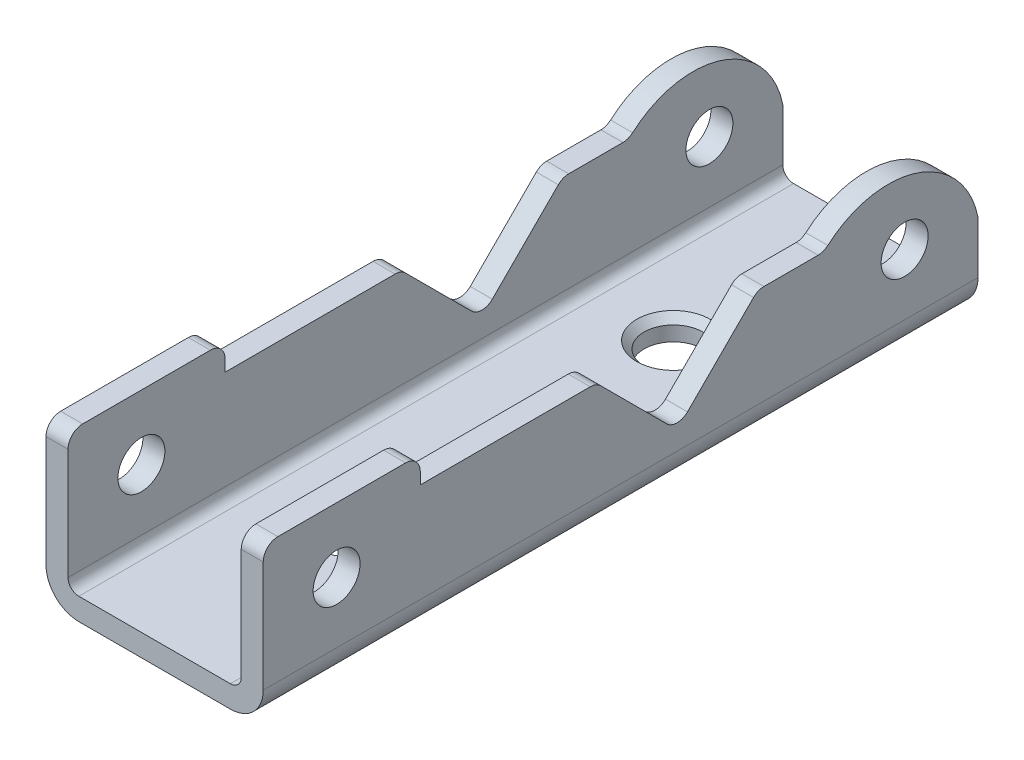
ISO-10303-21;
HEADER;
FILE_DESCRIPTION(('STEP AP214'),'2;1');
FILE_NAME('part.step','',(''),(''),'','','');
FILE_SCHEMA(('AUTOMOTIVE_DESIGN { 1 0 10303 214 1 1 1 1 }'));
ENDSEC;
DATA;
#1=APPLICATION_CONTEXT('core data for automotive mechanical design processes');
#2=APPLICATION_PROTOCOL_DEFINITION('international standard','automotive_design',2000,#1);
#3=PRODUCT_CONTEXT('',#1,'mechanical');
#4=PRODUCT('Part','Part','',(#3));
#5=PRODUCT_RELATED_PRODUCT_CATEGORY('part','',(#4));
#6=PRODUCT_DEFINITION_FORMATION('','',#4);
#7=PRODUCT_DEFINITION_CONTEXT('part definition',#1,'design');
#8=PRODUCT_DEFINITION('design','',#6,#7);
#9=PRODUCT_DEFINITION_SHAPE('','',#8);
#10=(LENGTH_UNIT() NAMED_UNIT(*) SI_UNIT(.MILLI.,.METRE.));
#11=(NAMED_UNIT(*) PLANE_ANGLE_UNIT() SI_UNIT($,.RADIAN.));
#12=(NAMED_UNIT(*) SI_UNIT($,.STERADIAN.) SOLID_ANGLE_UNIT());
#13=UNCERTAINTY_MEASURE_WITH_UNIT(LENGTH_MEASURE(1.E-05),#10,'distance_accuracy_value','');
#14=(GEOMETRIC_REPRESENTATION_CONTEXT(3) GLOBAL_UNCERTAINTY_ASSIGNED_CONTEXT((#13)) GLOBAL_UNIT_ASSIGNED_CONTEXT((#10,
#11,#12)) REPRESENTATION_CONTEXT('',''));
#15=CARTESIAN_POINT('',(0.,0.,0.));
#16=DIRECTION('',(0.,0.,1.));
#17=DIRECTION('',(1.,0.,0.));
#18=AXIS2_PLACEMENT_3D('',#15,#16,#17);
#19=CARTESIAN_POINT('',(40.1094934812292,8.50000000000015,-13.4570692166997));
#20=DIRECTION('',(-1.,0.,0.));
#21=DIRECTION('',(0.,-1.,0.));
#22=AXIS2_PLACEMENT_3D('',#19,#20,#21);
#23=CYLINDRICAL_SURFACE('',#22,1.);
#24=DIRECTION('',(-1.,0.,0.));
#25=VECTOR('',#24,1.);
#26=CARTESIAN_POINT('',(40.1094934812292,7.74862080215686,-14.1169398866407));
#27=LINE('',#26,#25);
#28=CARTESIAN_POINT('',(5.90000000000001,7.74862080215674,-14.1169398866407));
#29=VERTEX_POINT('',#28);
#30=CARTESIAN_POINT('',(7.40000000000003,7.74862080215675,-14.1169398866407));
#31=VERTEX_POINT('',#30);
#32=EDGE_CURVE('E376',#29,#31,#27,.F.);
#33=ORIENTED_EDGE('',*,*,#32,.F.);
#34=CARTESIAN_POINT('',(5.90000000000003,8.50000000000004,-13.4570692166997));
#35=DIRECTION('',(-1.,0.,0.));
#36=DIRECTION('',(0.,-1.,0.));
#37=AXIS2_PLACEMENT_3D('',#34,#35,#36);
#38=CIRCLE('',#37,1.);
#39=CARTESIAN_POINT('',(5.90000000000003,7.50000000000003,-13.4570692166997));
#40=VERTEX_POINT('',#39);
#41=EDGE_CURVE('E248',#40,#29,#38,.F.);
#42=ORIENTED_EDGE('',*,*,#41,.F.);
#43=DIRECTION('',(-1.,0.,0.));
#44=VECTOR('',#43,1.);
#45=CARTESIAN_POINT('',(40.1094934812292,7.50000000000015,-13.4570692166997));
#46=LINE('',#45,#44);
#47=CARTESIAN_POINT('',(7.40000000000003,7.50000000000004,-13.4570692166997));
#48=VERTEX_POINT('',#47);
#49=EDGE_CURVE('E250',#48,#40,#46,.T.);
#50=ORIENTED_EDGE('',*,*,#49,.F.);
#51=CARTESIAN_POINT('',(7.40000000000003,8.50000000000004,-13.4570692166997));
#52=DIRECTION('',(-1.,0.,0.));
#53=DIRECTION('',(0.,-1.,0.));
#54=AXIS2_PLACEMENT_3D('',#51,#52,#53);
#55=CIRCLE('',#54,1.);
#56=EDGE_CURVE('E19',#31,#48,#55,.T.);
#57=ORIENTED_EDGE('',*,*,#56,.F.);
#58=EDGE_LOOP('',(#33,#42,#50,#57));
#59=FACE_BOUND('',#58,.T.);
#60=ADVANCED_FACE('F16',(#59),#23,.F.);
#61=CARTESIAN_POINT('',(5.9,0.,0.));
#62=DIRECTION('',(-1.,0.,0.));
#63=DIRECTION('',(0.,-1.,0.));
#64=AXIS2_PLACEMENT_3D('',#61,#62,#63);
#65=PLANE('',#64);
#66=CARTESIAN_POINT('',(5.90000000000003,4.90000000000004,19.35));
#67=DIRECTION('',(-1.,0.,0.));
#68=DIRECTION('',(0.,-1.,0.));
#69=AXIS2_PLACEMENT_3D('',#66,#67,#68);
#70=CIRCLE('',#69,1.6);
#71=CARTESIAN_POINT('',(5.90000000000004,3.30000000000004,19.35));
#72=VERTEX_POINT('',#71);
#73=EDGE_CURVE('E522',#72,#72,#70,.F.);
#74=ORIENTED_EDGE('',*,*,#73,.T.);
#75=EDGE_LOOP('',(#74));
#76=FACE_BOUND('',#75,.T.);
#77=CARTESIAN_POINT('',(5.90000000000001,4.90000000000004,-19.35));
#78=DIRECTION('',(-1.,0.,0.));
#79=DIRECTION('',(0.,-1.,0.));
#80=AXIS2_PLACEMENT_3D('',#77,#78,#79);
#81=CIRCLE('',#80,1.6);
#82=CARTESIAN_POINT('',(5.90000000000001,3.30000000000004,-19.35));
#83=VERTEX_POINT('',#82);
#84=EDGE_CURVE('E357',#83,#83,#81,.F.);
#85=ORIENTED_EDGE('',*,*,#84,.T.);
#86=EDGE_LOOP('',(#85));
#87=FACE_BOUND('',#86,.T.);
#88=DIRECTION('',(0.,1.,0.));
#89=VECTOR('',#88,1.);
#90=CARTESIAN_POINT('',(5.90000000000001,0.,24.35));
#91=LINE('',#90,#89);
#92=CARTESIAN_POINT('',(5.90000000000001,0.736599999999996,24.35));
#93=VERTEX_POINT('',#92);
#94=CARTESIAN_POINT('',(5.90000000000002,8.3,24.35));
#95=VERTEX_POINT('',#94);
#96=EDGE_CURVE('E400',#93,#95,#91,.T.);
#97=ORIENTED_EDGE('',*,*,#96,.T.);
#98=CARTESIAN_POINT('',(5.90000000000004,8.3,23.35));
#99=DIRECTION('',(-1.,0.,0.));
#100=DIRECTION('',(0.,-1.,0.));
#101=AXIS2_PLACEMENT_3D('',#98,#99,#100);
#102=CIRCLE('',#101,1.);
#103=CARTESIAN_POINT('',(5.90000000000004,9.3,23.35));
#104=VERTEX_POINT('',#103);
#105=EDGE_CURVE('E371',#104,#95,#102,.F.);
#106=ORIENTED_EDGE('',*,*,#105,.F.);
#107=DIRECTION('',(0.,0.,1.));
#108=VECTOR('',#107,1.);
#109=CARTESIAN_POINT('',(5.90000000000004,9.3,24.35));
#110=LINE('',#109,#108);
#111=CARTESIAN_POINT('',(5.90000000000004,9.3,14.65));
#112=VERTEX_POINT('',#111);
#113=EDGE_CURVE('E367',#104,#112,#110,.F.);
#114=ORIENTED_EDGE('',*,*,#113,.T.);
#115=CARTESIAN_POINT('',(5.90000000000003,8.3,14.65));
#116=DIRECTION('',(1.,0.,0.));
#117=DIRECTION('',(0.,1.,0.));
#118=AXIS2_PLACEMENT_3D('',#115,#116,#117);
#119=CIRCLE('',#118,1.);
#120=CARTESIAN_POINT('',(5.90000000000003,8.3,13.65));
#121=VERTEX_POINT('',#120);
#122=EDGE_CURVE('E363',#121,#112,#119,.T.);
#123=ORIENTED_EDGE('',*,*,#122,.F.);
#124=DIRECTION('',(0.,1.,0.));
#125=VECTOR('',#124,1.);
#126=CARTESIAN_POINT('',(5.90000000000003,1.64649570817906E-13,13.65));
#127=LINE('',#126,#125);
#128=CARTESIAN_POINT('',(5.90000000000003,7.50000000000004,13.65));
#129=VERTEX_POINT('',#128);
#130=EDGE_CURVE('E354',#129,#121,#127,.T.);
#131=ORIENTED_EDGE('',*,*,#130,.F.);
#132=DIRECTION('',(0.,0.,1.));
#133=VECTOR('',#132,1.);
#134=CARTESIAN_POINT('',(5.90000000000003,7.50000000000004,0.));
#135=LINE('',#134,#133);
#136=CARTESIAN_POINT('',(5.90000000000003,7.50000000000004,2.0642135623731));
#137=VERTEX_POINT('',#136);
#138=EDGE_CURVE('E420',#137,#129,#135,.T.);
#139=ORIENTED_EDGE('',*,*,#138,.F.);
#140=CARTESIAN_POINT('',(5.90000000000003,6.50000000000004,2.0642135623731));
#141=DIRECTION('',(-1.,0.,0.));
#142=DIRECTION('',(0.,-1.,0.));
#143=AXIS2_PLACEMENT_3D('',#140,#141,#142);
#144=CIRCLE('',#143,1.);
#145=CARTESIAN_POINT('',(5.90000000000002,7.20710678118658,1.35710678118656));
#146=VERTEX_POINT('',#145);
#147=EDGE_CURVE('E398',#146,#137,#144,.F.);
#148=ORIENTED_EDGE('',*,*,#147,.F.);
#149=DIRECTION('',(0.,0.707106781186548,0.707106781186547));
#150=VECTOR('',#149,1.);
#151=CARTESIAN_POINT('',(5.90000000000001,2.92500000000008,-2.92499999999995));
#152=LINE('',#151,#150);
#153=CARTESIAN_POINT('',(5.90000000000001,2.70710678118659,-3.14289321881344));
#154=VERTEX_POINT('',#153);
#155=EDGE_CURVE('E394',#154,#146,#152,.T.);
#156=ORIENTED_EDGE('',*,*,#155,.F.);
#157=CARTESIAN_POINT('',(5.90000000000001,3.41421356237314,-3.84999999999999));
#158=DIRECTION('',(1.,0.,0.));
#159=DIRECTION('',(0.,1.,0.));
#160=AXIS2_PLACEMENT_3D('',#157,#158,#159);
#161=CIRCLE('',#160,1.);
#162=CARTESIAN_POINT('',(5.90000000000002,2.70710678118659,-4.55710678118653));
#163=VERTEX_POINT('',#162);
#164=EDGE_CURVE('E390',#154,#163,#161,.T.);
#165=ORIENTED_EDGE('',*,*,#164,.T.);
#166=DIRECTION('',(0.,-0.707106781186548,0.707106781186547));
#167=VECTOR('',#166,1.);
#168=CARTESIAN_POINT('',(5.90000000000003,-0.924999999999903,-0.925000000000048));
#169=LINE('',#168,#167);
#170=CARTESIAN_POINT('',(5.90000000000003,7.20710678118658,-9.05710678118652));
#171=VERTEX_POINT('',#170);
#172=EDGE_CURVE('E386',#171,#163,#169,.T.);
#173=ORIENTED_EDGE('',*,*,#172,.F.);
#174=CARTESIAN_POINT('',(5.90000000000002,6.50000000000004,-9.76421356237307));
#175=DIRECTION('',(-1.,0.,0.));
#176=DIRECTION('',(0.,-1.,0.));
#177=AXIS2_PLACEMENT_3D('',#174,#175,#176);
#178=CIRCLE('',#177,1.);
#179=CARTESIAN_POINT('',(5.90000000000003,7.50000000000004,-9.76421356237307));
#180=VERTEX_POINT('',#179);
#181=EDGE_CURVE('E382',#180,#171,#178,.F.);
#182=ORIENTED_EDGE('',*,*,#181,.F.);
#183=DIRECTION('',(0.,0.,1.));
#184=VECTOR('',#183,1.);
#185=CARTESIAN_POINT('',(5.90000000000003,7.50000000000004,0.));
#186=LINE('',#185,#184);
#187=EDGE_CURVE('E254',#40,#180,#186,.T.);
#188=ORIENTED_EDGE('',*,*,#187,.F.);
#189=ORIENTED_EDGE('',*,*,#41,.T.);
#190=CARTESIAN_POINT('',(5.9,3.06005875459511,-18.2344940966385));
#191=DIRECTION('',(-1.,0.,0.));
#192=DIRECTION('',(0.,-1.,0.));
#193=AXIS2_PLACEMENT_3D('',#190,#191,#192);
#194=CIRCLE('',#193,6.23994124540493);
#195=CARTESIAN_POINT('',(5.9,4.30000000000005,-24.35));
#196=VERTEX_POINT('',#195);
#197=EDGE_CURVE('E378',#196,#29,#194,.F.);
#198=ORIENTED_EDGE('',*,*,#197,.F.);
#199=DIRECTION('',(0.,-1.,0.));
#200=VECTOR('',#199,1.);
#201=CARTESIAN_POINT('',(5.9,9.29999999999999,-24.35));
#202=LINE('',#201,#200);
#203=CARTESIAN_POINT('',(5.9,0.736599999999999,-24.35));
#204=VERTEX_POINT('',#203);
#205=EDGE_CURVE('E375',#196,#204,#202,.T.);
#206=ORIENTED_EDGE('',*,*,#205,.T.);
#207=DIRECTION('',(0.,0.,-1.));
#208=VECTOR('',#207,1.);
#209=CARTESIAN_POINT('',(5.90000000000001,0.7366,-24.35));
#210=LINE('',#209,#208);
#211=EDGE_CURVE('E346',#204,#93,#210,.F.);
#212=ORIENTED_EDGE('',*,*,#211,.T.);
#213=EDGE_LOOP('',(#97,#106,#114,#123,#131,#139,#148,#156,#165,#173,#182,#188,#189,#198,#206,#212));
#214=FACE_BOUND('',#213,.T.);
#215=ADVANCED_FACE('F541',(#76,#87,#214),#65,.T.);
#216=CARTESIAN_POINT('',(40.1094934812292,8.50000000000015,-13.4570692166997));
#217=DIRECTION('',(-1.,0.,0.));
#218=DIRECTION('',(0.,-1.,0.));
#219=AXIS2_PLACEMENT_3D('',#216,#217,#218);
#220=CYLINDRICAL_SURFACE('',#219,1.);
#221=DIRECTION('',(-1.,0.,0.));
#222=VECTOR('',#221,1.);
#223=CARTESIAN_POINT('',(40.1094934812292,7.74862080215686,-14.1169398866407));
#224=LINE('',#223,#222);
#225=CARTESIAN_POINT('',(-7.40000000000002,7.7486208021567,-14.1169398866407));
#226=VERTEX_POINT('',#225);
#227=CARTESIAN_POINT('',(-5.90000000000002,7.7486208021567,-14.1169398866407));
#228=VERTEX_POINT('',#227);
#229=EDGE_CURVE('E339',#226,#228,#224,.F.);
#230=ORIENTED_EDGE('',*,*,#229,.F.);
#231=CARTESIAN_POINT('',(-7.40000000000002,8.49999999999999,-13.4570692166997));
#232=DIRECTION('',(-1.,0.,0.));
#233=DIRECTION('',(0.,-1.,0.));
#234=AXIS2_PLACEMENT_3D('',#231,#232,#233);
#235=CIRCLE('',#234,1.);
#236=CARTESIAN_POINT('',(-7.40000000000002,7.49999999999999,-13.4570692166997));
#237=VERTEX_POINT('',#236);
#238=EDGE_CURVE('E539',#237,#226,#235,.F.);
#239=ORIENTED_EDGE('',*,*,#238,.F.);
#240=DIRECTION('',(-1.,0.,0.));
#241=VECTOR('',#240,1.);
#242=CARTESIAN_POINT('',(40.1094934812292,7.50000000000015,-13.4570692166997));
#243=LINE('',#242,#241);
#244=CARTESIAN_POINT('',(-5.90000000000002,7.49999999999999,-13.4570692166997));
#245=VERTEX_POINT('',#244);
#246=EDGE_CURVE('E331',#245,#237,#243,.T.);
#247=ORIENTED_EDGE('',*,*,#246,.F.);
#248=CARTESIAN_POINT('',(-5.90000000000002,8.49999999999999,-13.4570692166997));
#249=DIRECTION('',(-1.,0.,0.));
#250=DIRECTION('',(0.,-1.,0.));
#251=AXIS2_PLACEMENT_3D('',#248,#249,#250);
#252=CIRCLE('',#251,1.);
#253=EDGE_CURVE('E423',#228,#245,#252,.T.);
#254=ORIENTED_EDGE('',*,*,#253,.F.);
#255=EDGE_LOOP('',(#230,#239,#247,#254));
#256=FACE_BOUND('',#255,.T.);
#257=ADVANCED_FACE('F943',(#256),#220,.F.);
#258=CARTESIAN_POINT('',(-5.9,0.,0.));
#259=DIRECTION('',(1.,0.,0.));
#260=DIRECTION('',(0.,1.,0.));
#261=AXIS2_PLACEMENT_3D('',#258,#259,#260);
#262=PLANE('',#261);
#263=CARTESIAN_POINT('',(-5.90000000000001,4.9,19.35));
#264=DIRECTION('',(-1.,0.,0.));
#265=DIRECTION('',(0.,-1.,0.));
#266=AXIS2_PLACEMENT_3D('',#263,#264,#265);
#267=CIRCLE('',#266,1.6);
#268=CARTESIAN_POINT('',(-5.9,3.3,19.35));
#269=VERTEX_POINT('',#268);
#270=EDGE_CURVE('E504',#269,#269,#267,.T.);
#271=ORIENTED_EDGE('',*,*,#270,.T.);
#272=EDGE_LOOP('',(#271));
#273=FACE_BOUND('',#272,.T.);
#274=CARTESIAN_POINT('',(-5.90000000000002,4.9,-19.35));
#275=DIRECTION('',(-1.,0.,0.));
#276=DIRECTION('',(0.,-1.,0.));
#277=AXIS2_PLACEMENT_3D('',#274,#275,#276);
#278=CIRCLE('',#277,1.6);
#279=CARTESIAN_POINT('',(-5.90000000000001,3.3,-19.35));
#280=VERTEX_POINT('',#279);
#281=EDGE_CURVE('E345',#280,#280,#278,.T.);
#282=ORIENTED_EDGE('',*,*,#281,.T.);
#283=EDGE_LOOP('',(#282));
#284=FACE_BOUND('',#283,.T.);
#285=DIRECTION('',(0.,1.,0.));
#286=VECTOR('',#285,1.);
#287=CARTESIAN_POINT('',(-5.90000000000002,1.64649570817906E-13,13.65));
#288=LINE('',#287,#286);
#289=CARTESIAN_POINT('',(-5.90000000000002,8.3,13.65));
#290=VERTEX_POINT('',#289);
#291=CARTESIAN_POINT('',(-5.90000000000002,7.5,13.65));
#292=VERTEX_POINT('',#291);
#293=EDGE_CURVE('E304',#290,#292,#288,.F.);
#294=ORIENTED_EDGE('',*,*,#293,.F.);
#295=CARTESIAN_POINT('',(-5.90000000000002,8.3,14.65));
#296=DIRECTION('',(1.,0.,0.));
#297=DIRECTION('',(0.,1.,0.));
#298=AXIS2_PLACEMENT_3D('',#295,#296,#297);
#299=CIRCLE('',#298,1.);
#300=CARTESIAN_POINT('',(-5.90000000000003,9.3,14.65));
#301=VERTEX_POINT('',#300);
#302=EDGE_CURVE('E300',#301,#290,#299,.F.);
#303=ORIENTED_EDGE('',*,*,#302,.F.);
#304=DIRECTION('',(0.,0.,1.));
#305=VECTOR('',#304,1.);
#306=CARTESIAN_POINT('',(-5.90000000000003,9.3,-24.35));
#307=LINE('',#306,#305);
#308=CARTESIAN_POINT('',(-5.90000000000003,9.3,23.35));
#309=VERTEX_POINT('',#308);
#310=EDGE_CURVE('E296',#301,#309,#307,.T.);
#311=ORIENTED_EDGE('',*,*,#310,.T.);
#312=CARTESIAN_POINT('',(-5.90000000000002,8.3,23.35));
#313=DIRECTION('',(1.,0.,0.));
#314=DIRECTION('',(0.,1.,0.));
#315=AXIS2_PLACEMENT_3D('',#312,#313,#314);
#316=CIRCLE('',#315,1.);
#317=CARTESIAN_POINT('',(-5.90000000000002,8.3,24.35));
#318=VERTEX_POINT('',#317);
#319=EDGE_CURVE('E292',#318,#309,#316,.F.);
#320=ORIENTED_EDGE('',*,*,#319,.F.);
#321=DIRECTION('',(0.,1.,0.));
#322=VECTOR('',#321,1.);
#323=CARTESIAN_POINT('',(-5.90000000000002,9.29999999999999,24.35));
#324=LINE('',#323,#322);
#325=CARTESIAN_POINT('',(-5.90000000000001,0.736599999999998,24.35));
#326=VERTEX_POINT('',#325);
#327=EDGE_CURVE('E288',#318,#326,#324,.F.);
#328=ORIENTED_EDGE('',*,*,#327,.T.);
#329=DIRECTION('',(0.,0.,1.));
#330=VECTOR('',#329,1.);
#331=CARTESIAN_POINT('',(-5.9,0.7366,24.35));
#332=LINE('',#331,#330);
#333=CARTESIAN_POINT('',(-5.9,0.736599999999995,-24.35));
#334=VERTEX_POINT('',#333);
#335=EDGE_CURVE('E417',#326,#334,#332,.F.);
#336=ORIENTED_EDGE('',*,*,#335,.T.);
#337=DIRECTION('',(0.,1.,0.));
#338=VECTOR('',#337,1.);
#339=CARTESIAN_POINT('',(-5.9,0.,-24.35));
#340=LINE('',#339,#338);
#341=CARTESIAN_POINT('',(-5.90000000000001,4.29999999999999,-24.35));
#342=VERTEX_POINT('',#341);
#343=EDGE_CURVE('E342',#334,#342,#340,.T.);
#344=ORIENTED_EDGE('',*,*,#343,.T.);
#345=CARTESIAN_POINT('',(-5.90000000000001,3.06005875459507,-18.2344940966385));
#346=DIRECTION('',(-1.,0.,0.));
#347=DIRECTION('',(0.,-1.,0.));
#348=AXIS2_PLACEMENT_3D('',#345,#346,#347);
#349=CIRCLE('',#348,6.23994124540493);
#350=EDGE_CURVE('E338',#228,#342,#349,.T.);
#351=ORIENTED_EDGE('',*,*,#350,.F.);
#352=ORIENTED_EDGE('',*,*,#253,.T.);
#353=DIRECTION('',(0.,0.,1.));
#354=VECTOR('',#353,1.);
#355=CARTESIAN_POINT('',(-5.90000000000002,7.5,0.));
#356=LINE('',#355,#354);
#357=CARTESIAN_POINT('',(-5.90000000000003,7.49999999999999,-9.76421356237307));
#358=VERTEX_POINT('',#357);
#359=EDGE_CURVE('E334',#358,#245,#356,.F.);
#360=ORIENTED_EDGE('',*,*,#359,.F.);
#361=CARTESIAN_POINT('',(-5.90000000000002,6.5,-9.76421356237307));
#362=DIRECTION('',(-1.,0.,0.));
#363=DIRECTION('',(0.,-1.,0.));
#364=AXIS2_PLACEMENT_3D('',#361,#362,#363);
#365=CIRCLE('',#364,1.);
#366=CARTESIAN_POINT('',(-5.90000000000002,7.20710678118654,-9.05710678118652));
#367=VERTEX_POINT('',#366);
#368=EDGE_CURVE('E330',#367,#358,#365,.T.);
#369=ORIENTED_EDGE('',*,*,#368,.F.);
#370=DIRECTION('',(0.,-0.707106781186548,0.707106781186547));
#371=VECTOR('',#370,1.);
#372=CARTESIAN_POINT('',(-5.90000000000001,-0.924999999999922,-0.925000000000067));
#373=LINE('',#372,#371);
#374=CARTESIAN_POINT('',(-5.90000000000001,2.70710678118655,-4.55710678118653));
#375=VERTEX_POINT('',#374);
#376=EDGE_CURVE('E326',#375,#367,#373,.F.);
#377=ORIENTED_EDGE('',*,*,#376,.F.);
#378=CARTESIAN_POINT('',(-5.90000000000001,3.41421356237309,-3.84999999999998));
#379=DIRECTION('',(1.,0.,0.));
#380=DIRECTION('',(0.,1.,0.));
#381=AXIS2_PLACEMENT_3D('',#378,#379,#380);
#382=CIRCLE('',#381,1.);
#383=CARTESIAN_POINT('',(-5.90000000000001,2.70710678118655,-3.14289321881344));
#384=VERTEX_POINT('',#383);
#385=EDGE_CURVE('E322',#375,#384,#382,.F.);
#386=ORIENTED_EDGE('',*,*,#385,.T.);
#387=DIRECTION('',(0.,0.707106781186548,0.707106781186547));
#388=VECTOR('',#387,1.);
#389=CARTESIAN_POINT('',(-5.90000000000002,2.92500000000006,-2.92499999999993));
#390=LINE('',#389,#388);
#391=CARTESIAN_POINT('',(-5.90000000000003,7.20710678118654,1.35710678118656));
#392=VERTEX_POINT('',#391);
#393=EDGE_CURVE('E318',#392,#384,#390,.F.);
#394=ORIENTED_EDGE('',*,*,#393,.F.);
#395=CARTESIAN_POINT('',(-5.90000000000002,6.5,2.06421356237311));
#396=DIRECTION('',(-1.,0.,0.));
#397=DIRECTION('',(0.,-1.,0.));
#398=AXIS2_PLACEMENT_3D('',#395,#396,#397);
#399=CIRCLE('',#398,1.);
#400=CARTESIAN_POINT('',(-5.90000000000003,7.5,2.06421356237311));
#401=VERTEX_POINT('',#400);
#402=EDGE_CURVE('E314',#401,#392,#399,.T.);
#403=ORIENTED_EDGE('',*,*,#402,.F.);
#404=DIRECTION('',(0.,0.,1.));
#405=VECTOR('',#404,1.);
#406=CARTESIAN_POINT('',(-5.90000000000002,7.5,0.));
#407=LINE('',#406,#405);
#408=EDGE_CURVE('E310',#292,#401,#407,.F.);
#409=ORIENTED_EDGE('',*,*,#408,.F.);
#410=EDGE_LOOP('',(#294,#303,#311,#320,#328,#336,#344,#351,#352,#360,#369,#377,#386,#394,#403,#409));
#411=FACE_BOUND('',#410,.T.);
#412=ADVANCED_FACE('F951',(#273,#284,#411),#262,.T.);
#413=CARTESIAN_POINT('',(40.1094934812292,7.50000000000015,0.));
#414=DIRECTION('',(0.,1.,0.));
#415=DIRECTION('',(-1.,0.,0.));
#416=AXIS2_PLACEMENT_3D('',#413,#414,#415);
#417=PLANE('',#416);
#418=ORIENTED_EDGE('',*,*,#138,.T.);
#419=DIRECTION('',(1.,0.,0.));
#420=VECTOR('',#419,1.);
#421=CARTESIAN_POINT('',(40.1094934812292,7.50000000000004,13.65));
#422=LINE('',#421,#420);
#423=CARTESIAN_POINT('',(7.40000000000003,7.50000000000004,13.65));
#424=VERTEX_POINT('',#423);
#425=EDGE_CURVE('E353',#424,#129,#422,.F.);
#426=ORIENTED_EDGE('',*,*,#425,.F.);
#427=DIRECTION('',(0.,0.,1.));
#428=VECTOR('',#427,1.);
#429=CARTESIAN_POINT('',(7.40000000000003,7.50000000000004,0.));
#430=LINE('',#429,#428);
#431=CARTESIAN_POINT('',(7.40000000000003,7.50000000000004,2.0642135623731));
#432=VERTEX_POINT('',#431);
#433=EDGE_CURVE('E275',#424,#432,#430,.F.);
#434=ORIENTED_EDGE('',*,*,#433,.T.);
#435=DIRECTION('',(-1.,0.,0.));
#436=VECTOR('',#435,1.);
#437=CARTESIAN_POINT('',(40.1094934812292,7.50000000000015,2.0642135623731));
#438=LINE('',#437,#436);
#439=EDGE_CURVE('E395',#137,#432,#438,.F.);
#440=ORIENTED_EDGE('',*,*,#439,.F.);
#441=EDGE_LOOP('',(#418,#426,#434,#440));
#442=FACE_BOUND('',#441,.T.);
#443=ADVANCED_FACE('F578',(#442),#417,.T.);
#444=CARTESIAN_POINT('',(40.1094934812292,6.50000000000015,2.0642135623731));
#445=DIRECTION('',(-1.,0.,0.));
#446=DIRECTION('',(0.,-1.,0.));
#447=AXIS2_PLACEMENT_3D('',#444,#445,#446);
#448=CYLINDRICAL_SURFACE('',#447,1.);
#449=ORIENTED_EDGE('',*,*,#147,.T.);
#450=ORIENTED_EDGE('',*,*,#439,.T.);
#451=CARTESIAN_POINT('',(7.40000000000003,6.50000000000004,2.0642135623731));
#452=DIRECTION('',(-1.,0.,0.));
#453=DIRECTION('',(0.,-1.,0.));
#454=AXIS2_PLACEMENT_3D('',#451,#452,#453);
#455=CIRCLE('',#454,1.);
#456=CARTESIAN_POINT('',(7.40000000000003,7.20710678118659,1.35710678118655));
#457=VERTEX_POINT('',#456);
#458=EDGE_CURVE('E274',#432,#457,#455,.T.);
#459=ORIENTED_EDGE('',*,*,#458,.T.);
#460=DIRECTION('',(1.,0.,0.));
#461=VECTOR('',#460,1.);
#462=CARTESIAN_POINT('',(40.1094934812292,7.20710678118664,1.35710678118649));
#463=LINE('',#462,#461);
#464=EDGE_CURVE('E391',#146,#457,#463,.T.);
#465=ORIENTED_EDGE('',*,*,#464,.F.);
#466=EDGE_LOOP('',(#449,#450,#459,#465));
#467=FACE_BOUND('',#466,.T.);
#468=ADVANCED_FACE('F588',(#467),#448,.T.);
#469=CARTESIAN_POINT('',(40.1094934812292,2.92500000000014,-2.92500000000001));
#470=DIRECTION('',(0.,0.707106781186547,-0.707106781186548));
#471=DIRECTION('',(0.,0.707106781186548,0.707106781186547));
#472=AXIS2_PLACEMENT_3D('',#469,#470,#471);
#473=PLANE('',#472);
#474=DIRECTION('',(0.,-0.707106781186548,-0.707106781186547));
#475=VECTOR('',#474,1.);
#476=CARTESIAN_POINT('',(7.40000000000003,7.20710678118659,1.35710678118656));
#477=LINE('',#476,#475);
#478=CARTESIAN_POINT('',(7.40000000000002,2.70710678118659,-3.14289321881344));
#479=VERTEX_POINT('',#478);
#480=EDGE_CURVE('E272',#457,#479,#477,.T.);
#481=ORIENTED_EDGE('',*,*,#480,.T.);
#482=DIRECTION('',(1.,0.,0.));
#483=VECTOR('',#482,1.);
#484=CARTESIAN_POINT('',(40.1094934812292,2.70710678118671,-3.14289321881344));
#485=LINE('',#484,#483);
#486=EDGE_CURVE('E387',#479,#154,#485,.F.);
#487=ORIENTED_EDGE('',*,*,#486,.T.);
#488=ORIENTED_EDGE('',*,*,#155,.T.);
#489=ORIENTED_EDGE('',*,*,#464,.T.);
#490=EDGE_LOOP('',(#481,#487,#488,#489));
#491=FACE_BOUND('',#490,.T.);
#492=ADVANCED_FACE('F594',(#491),#473,.T.);
#493=CARTESIAN_POINT('',(40.1094934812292,3.41421356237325,-3.84999999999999));
#494=DIRECTION('',(1.,0.,0.));
#495=DIRECTION('',(0.,1.,0.));
#496=AXIS2_PLACEMENT_3D('',#493,#494,#495);
#497=CYLINDRICAL_SURFACE('',#496,1.);
#498=DIRECTION('',(1.,0.,0.));
#499=VECTOR('',#498,1.);
#500=CARTESIAN_POINT('',(40.1094934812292,2.70710678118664,-4.55710678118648));
#501=LINE('',#500,#499);
#502=CARTESIAN_POINT('',(7.40000000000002,2.70710678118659,-4.55710678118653));
#503=VERTEX_POINT('',#502);
#504=EDGE_CURVE('E383',#163,#503,#501,.T.);
#505=ORIENTED_EDGE('',*,*,#504,.F.);
#506=ORIENTED_EDGE('',*,*,#164,.F.);
#507=ORIENTED_EDGE('',*,*,#486,.F.);
#508=CARTESIAN_POINT('',(7.40000000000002,3.41421356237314,-3.84999999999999));
#509=DIRECTION('',(1.,0.,0.));
#510=DIRECTION('',(0.,1.,0.));
#511=AXIS2_PLACEMENT_3D('',#508,#509,#510);
#512=CIRCLE('',#511,1.);
#513=EDGE_CURVE('E271',#479,#503,#512,.T.);
#514=ORIENTED_EDGE('',*,*,#513,.T.);
#515=EDGE_LOOP('',(#505,#506,#507,#514));
#516=FACE_BOUND('',#515,.T.);
#517=ADVANCED_FACE('F597',(#516),#497,.F.);
#518=CARTESIAN_POINT('',(40.1094934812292,-0.924999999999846,-0.924999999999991));
#519=DIRECTION('',(0.,0.707106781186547,0.707106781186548));
#520=DIRECTION('',(0.,-0.707106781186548,0.707106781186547));
#521=AXIS2_PLACEMENT_3D('',#518,#519,#520);
#522=PLANE('',#521);
#523=ORIENTED_EDGE('',*,*,#172,.T.);
#524=ORIENTED_EDGE('',*,*,#504,.T.);
#525=DIRECTION('',(0.,0.707106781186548,-0.707106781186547));
#526=VECTOR('',#525,1.);
#527=CARTESIAN_POINT('',(7.40000000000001,2.70710678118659,-4.55710678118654));
#528=LINE('',#527,#526);
#529=CARTESIAN_POINT('',(7.40000000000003,7.20710678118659,-9.05710678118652));
#530=VERTEX_POINT('',#529);
#531=EDGE_CURVE('E265',#503,#530,#528,.T.);
#532=ORIENTED_EDGE('',*,*,#531,.T.);
#533=DIRECTION('',(-1.,0.,0.));
#534=VECTOR('',#533,1.);
#535=CARTESIAN_POINT('',(40.1094934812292,7.2071067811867,-9.05710678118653));
#536=LINE('',#535,#534);
#537=EDGE_CURVE('E255',#171,#530,#536,.F.);
#538=ORIENTED_EDGE('',*,*,#537,.F.);
#539=EDGE_LOOP('',(#523,#524,#532,#538));
#540=FACE_BOUND('',#539,.T.);
#541=ADVANCED_FACE('F601',(#540),#522,.T.);
#542=CARTESIAN_POINT('',(40.1094934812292,6.50000000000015,-9.76421356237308));
#543=DIRECTION('',(-1.,0.,0.));
#544=DIRECTION('',(0.,-1.,0.));
#545=AXIS2_PLACEMENT_3D('',#542,#543,#544);
#546=CYLINDRICAL_SURFACE('',#545,1.);
#547=ORIENTED_EDGE('',*,*,#181,.T.);
#548=ORIENTED_EDGE('',*,*,#537,.T.);
#549=CARTESIAN_POINT('',(7.40000000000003,6.50000000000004,-9.76421356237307));
#550=DIRECTION('',(-1.,0.,0.));
#551=DIRECTION('',(0.,-1.,0.));
#552=AXIS2_PLACEMENT_3D('',#549,#550,#551);
#553=CIRCLE('',#552,1.);
#554=CARTESIAN_POINT('',(7.40000000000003,7.50000000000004,-9.76421356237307));
#555=VERTEX_POINT('',#554);
#556=EDGE_CURVE('E261',#530,#555,#553,.T.);
#557=ORIENTED_EDGE('',*,*,#556,.T.);
#558=DIRECTION('',(-1.,0.,0.));
#559=VECTOR('',#558,1.);
#560=CARTESIAN_POINT('',(40.1094934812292,7.50000000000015,-9.76421356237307));
#561=LINE('',#560,#559);
#562=EDGE_CURVE('E260',#180,#555,#561,.F.);
#563=ORIENTED_EDGE('',*,*,#562,.F.);
#564=EDGE_LOOP('',(#547,#548,#557,#563));
#565=FACE_BOUND('',#564,.T.);
#566=ADVANCED_FACE('F603',(#565),#546,.T.);
#567=CARTESIAN_POINT('',(40.1094934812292,7.50000000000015,0.));
#568=DIRECTION('',(0.,1.,0.));
#569=DIRECTION('',(-1.,0.,0.));
#570=AXIS2_PLACEMENT_3D('',#567,#568,#569);
#571=PLANE('',#570);
#572=ORIENTED_EDGE('',*,*,#187,.T.);
#573=ORIENTED_EDGE('',*,*,#562,.T.);
#574=DIRECTION('',(0.,0.,1.));
#575=VECTOR('',#574,1.);
#576=CARTESIAN_POINT('',(7.40000000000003,7.50000000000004,0.));
#577=LINE('',#576,#575);
#578=EDGE_CURVE('E245',#555,#48,#577,.F.);
#579=ORIENTED_EDGE('',*,*,#578,.T.);
#580=ORIENTED_EDGE('',*,*,#49,.T.);
#581=EDGE_LOOP('',(#572,#573,#579,#580));
#582=FACE_BOUND('',#581,.T.);
#583=ADVANCED_FACE('F258',(#582),#571,.T.);
#584=CARTESIAN_POINT('',(40.1094934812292,3.06005875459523,-18.2344940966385));
#585=DIRECTION('',(-1.,0.,0.));
#586=DIRECTION('',(0.,-1.,0.));
#587=AXIS2_PLACEMENT_3D('',#584,#585,#586);
#588=CYLINDRICAL_SURFACE('',#587,6.23994124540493);
#589=CARTESIAN_POINT('',(7.40000000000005,3.06005875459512,-18.2344940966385));
#590=DIRECTION('',(-1.,0.,0.));
#591=DIRECTION('',(0.,-1.,0.));
#592=AXIS2_PLACEMENT_3D('',#589,#590,#591);
#593=CIRCLE('',#592,6.23994124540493);
#594=CARTESIAN_POINT('',(7.40000000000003,4.30000000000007,-24.35));
#595=VERTEX_POINT('',#594);
#596=EDGE_CURVE('E247',#31,#595,#593,.T.);
#597=ORIENTED_EDGE('',*,*,#596,.T.);
#598=DIRECTION('',(1.,0.,0.));
#599=VECTOR('',#598,1.);
#600=CARTESIAN_POINT('',(7.40000000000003,4.30000000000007,-24.35));
#601=LINE('',#600,#599);
#602=EDGE_CURVE('E372',#595,#196,#601,.F.);
#603=ORIENTED_EDGE('',*,*,#602,.T.);
#604=ORIENTED_EDGE('',*,*,#197,.T.);
#605=ORIENTED_EDGE('',*,*,#32,.T.);
#606=EDGE_LOOP('',(#597,#603,#604,#605));
#607=FACE_BOUND('',#606,.T.);
#608=ADVANCED_FACE('F543',(#607),#588,.T.);
#609=CARTESIAN_POINT('',(7.40000000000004,8.29999999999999,23.35));
#610=DIRECTION('',(-1.,0.,0.));
#611=DIRECTION('',(0.,-1.,0.));
#612=AXIS2_PLACEMENT_3D('',#609,#610,#611);
#613=CYLINDRICAL_SURFACE('',#612,1.);
#614=ORIENTED_EDGE('',*,*,#105,.T.);
#615=DIRECTION('',(-1.,0.,0.));
#616=VECTOR('',#615,1.);
#617=CARTESIAN_POINT('',(7.40000000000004,8.29999999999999,24.35));
#618=LINE('',#617,#616);
#619=CARTESIAN_POINT('',(7.40000000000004,8.29999999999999,24.35));
#620=VERTEX_POINT('',#619);
#621=EDGE_CURVE('E368',#95,#620,#618,.F.);
#622=ORIENTED_EDGE('',*,*,#621,.T.);
#623=CARTESIAN_POINT('',(7.40000000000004,8.29999999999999,23.35));
#624=DIRECTION('',(-1.,0.,0.));
#625=DIRECTION('',(0.,-1.,0.));
#626=AXIS2_PLACEMENT_3D('',#623,#624,#625);
#627=CIRCLE('',#626,1.);
#628=CARTESIAN_POINT('',(7.40000000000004,9.29999999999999,23.35));
#629=VERTEX_POINT('',#628);
#630=EDGE_CURVE('E498',#620,#629,#627,.T.);
#631=ORIENTED_EDGE('',*,*,#630,.T.);
#632=DIRECTION('',(1.,0.,0.));
#633=VECTOR('',#632,1.);
#634=CARTESIAN_POINT('',(7.40000000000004,9.29999999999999,23.35));
#635=LINE('',#634,#633);
#636=EDGE_CURVE('E364',#629,#104,#635,.F.);
#637=ORIENTED_EDGE('',*,*,#636,.T.);
#638=EDGE_LOOP('',(#614,#622,#631,#637));
#639=FACE_BOUND('',#638,.T.);
#640=ADVANCED_FACE('F564',(#639),#613,.T.);
#641=CARTESIAN_POINT('',(7.40000000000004,9.29999999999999,24.35));
#642=DIRECTION('',(0.,-1.,0.));
#643=DIRECTION('',(1.,0.,0.));
#644=AXIS2_PLACEMENT_3D('',#641,#642,#643);
#645=PLANE('',#644);
#646=DIRECTION('',(1.,0.,0.));
#647=VECTOR('',#646,1.);
#648=CARTESIAN_POINT('',(7.40000000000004,9.29999999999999,14.65));
#649=LINE('',#648,#647);
#650=CARTESIAN_POINT('',(7.40000000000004,9.29999999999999,14.65));
#651=VERTEX_POINT('',#650);
#652=EDGE_CURVE('E360',#112,#651,#649,.T.);
#653=ORIENTED_EDGE('',*,*,#652,.F.);
#654=ORIENTED_EDGE('',*,*,#113,.F.);
#655=ORIENTED_EDGE('',*,*,#636,.F.);
#656=DIRECTION('',(0.,0.,1.));
#657=VECTOR('',#656,1.);
#658=CARTESIAN_POINT('',(7.40000000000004,9.29999999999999,0.));
#659=LINE('',#658,#657);
#660=EDGE_CURVE('E497',#629,#651,#659,.F.);
#661=ORIENTED_EDGE('',*,*,#660,.T.);
#662=EDGE_LOOP('',(#653,#654,#655,#661));
#663=FACE_BOUND('',#662,.T.);
#664=ADVANCED_FACE('F568',(#663),#645,.F.);
#665=CARTESIAN_POINT('',(7.40000000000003,8.29999999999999,14.65));
#666=DIRECTION('',(1.,0.,0.));
#667=DIRECTION('',(0.,1.,0.));
#668=AXIS2_PLACEMENT_3D('',#665,#666,#667);
#669=CYLINDRICAL_SURFACE('',#668,1.);
#670=ORIENTED_EDGE('',*,*,#122,.T.);
#671=ORIENTED_EDGE('',*,*,#652,.T.);
#672=CARTESIAN_POINT('',(7.40000000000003,8.29999999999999,14.65));
#673=DIRECTION('',(1.,0.,0.));
#674=DIRECTION('',(0.,1.,0.));
#675=AXIS2_PLACEMENT_3D('',#672,#673,#674);
#676=CIRCLE('',#675,1.);
#677=CARTESIAN_POINT('',(7.40000000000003,8.29999999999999,13.65));
#678=VERTEX_POINT('',#677);
#679=EDGE_CURVE('E495',#651,#678,#676,.F.);
#680=ORIENTED_EDGE('',*,*,#679,.T.);
#681=DIRECTION('',(1.,0.,0.));
#682=VECTOR('',#681,1.);
#683=CARTESIAN_POINT('',(40.1094934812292,8.3,13.65));
#684=LINE('',#683,#682);
#685=EDGE_CURVE('E350',#121,#678,#684,.T.);
#686=ORIENTED_EDGE('',*,*,#685,.F.);
#687=EDGE_LOOP('',(#670,#671,#680,#686));
#688=FACE_BOUND('',#687,.T.);
#689=ADVANCED_FACE('F571',(#688),#669,.T.);
#690=CARTESIAN_POINT('',(40.1094934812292,1.64649570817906E-13,13.65));
#691=DIRECTION('',(0.,0.,-1.));
#692=DIRECTION('',(0.,1.,0.));
#693=AXIS2_PLACEMENT_3D('',#690,#691,#692);
#694=PLANE('',#693);
#695=DIRECTION('',(0.,-1.,0.));
#696=VECTOR('',#695,1.);
#697=CARTESIAN_POINT('',(7.40000000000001,0.,13.65));
#698=LINE('',#697,#696);
#699=EDGE_CURVE('E494',#678,#424,#698,.T.);
#700=ORIENTED_EDGE('',*,*,#699,.T.);
#701=ORIENTED_EDGE('',*,*,#425,.T.);
#702=ORIENTED_EDGE('',*,*,#130,.T.);
#703=ORIENTED_EDGE('',*,*,#685,.T.);
#704=EDGE_LOOP('',(#700,#701,#702,#703));
#705=FACE_BOUND('',#704,.T.);
#706=ADVANCED_FACE('F580',(#705),#694,.T.);
#707=CARTESIAN_POINT('',(11.9254833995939,4.90000000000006,-19.35));
#708=DIRECTION('',(-1.,0.,0.));
#709=DIRECTION('',(0.,-1.,0.));
#710=AXIS2_PLACEMENT_3D('',#707,#708,#709);
#711=CYLINDRICAL_SURFACE('',#710,1.6);
#712=ORIENTED_EDGE('',*,*,#84,.F.);
#713=EDGE_LOOP('',(#712));
#714=FACE_BOUND('',#713,.T.);
#715=CARTESIAN_POINT('',(7.40000000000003,4.90000000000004,-19.35));
#716=DIRECTION('',(-1.,0.,0.));
#717=DIRECTION('',(0.,-1.,0.));
#718=AXIS2_PLACEMENT_3D('',#715,#716,#717);
#719=CIRCLE('',#718,1.6);
#720=CARTESIAN_POINT('',(7.40000000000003,3.30000000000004,-19.35));
#721=VERTEX_POINT('',#720);
#722=EDGE_CURVE('E491',#721,#721,#719,.F.);
#723=ORIENTED_EDGE('',*,*,#722,.T.);
#724=EDGE_LOOP('',(#723));
#725=FACE_BOUND('',#724,.T.);
#726=ADVANCED_FACE('F727',(#714,#725),#711,.F.);
#727=CARTESIAN_POINT('',(11.9254833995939,4.90000000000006,19.35));
#728=DIRECTION('',(-1.,0.,0.));
#729=DIRECTION('',(0.,-1.,0.));
#730=AXIS2_PLACEMENT_3D('',#727,#728,#729);
#731=CYLINDRICAL_SURFACE('',#730,1.6);
#732=CARTESIAN_POINT('',(7.40000000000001,4.90000000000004,19.35));
#733=DIRECTION('',(-1.,0.,0.));
#734=DIRECTION('',(0.,-1.,0.));
#735=AXIS2_PLACEMENT_3D('',#732,#733,#734);
#736=CIRCLE('',#735,1.6);
#737=CARTESIAN_POINT('',(7.40000000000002,3.30000000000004,19.35));
#738=VERTEX_POINT('',#737);
#739=EDGE_CURVE('E488',#738,#738,#736,.F.);
#740=ORIENTED_EDGE('',*,*,#739,.T.);
#741=EDGE_LOOP('',(#740));
#742=FACE_BOUND('',#741,.T.);
#743=ORIENTED_EDGE('',*,*,#73,.F.);
#744=EDGE_LOOP('',(#743));
#745=FACE_BOUND('',#744,.T.);
#746=ADVANCED_FACE('F723',(#742,#745),#731,.F.);
#747=CARTESIAN_POINT('',(-5.1634,0.736600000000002,24.35));
#748=DIRECTION('',(0.,0.,1.));
#749=DIRECTION('',(0.,-1.,0.));
#750=AXIS2_PLACEMENT_3D('',#747,#748,#749);
#751=CYLINDRICAL_SURFACE('',#750,0.736600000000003);
#752=CARTESIAN_POINT('',(-5.1634,0.736599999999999,-24.35));
#753=DIRECTION('',(0.,0.,1.));
#754=DIRECTION('',(0.,-1.,0.));
#755=AXIS2_PLACEMENT_3D('',#752,#753,#754);
#756=CIRCLE('',#755,0.736600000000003);
#757=CARTESIAN_POINT('',(-5.1634,0.,-24.35));
#758=VERTEX_POINT('',#757);
#759=EDGE_CURVE('E349',#334,#758,#756,.T.);
#760=ORIENTED_EDGE('',*,*,#759,.F.);
#761=ORIENTED_EDGE('',*,*,#335,.F.);
#762=CARTESIAN_POINT('',(-5.1634,0.736600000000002,24.35));
#763=DIRECTION('',(0.,0.,1.));
#764=DIRECTION('',(0.,-1.,0.));
#765=AXIS2_PLACEMENT_3D('',#762,#763,#764);
#766=CIRCLE('',#765,0.736600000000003);
#767=CARTESIAN_POINT('',(-5.1634,0.,24.35));
#768=VERTEX_POINT('',#767);
#769=EDGE_CURVE('E419',#768,#326,#766,.F.);
#770=ORIENTED_EDGE('',*,*,#769,.F.);
#771=DIRECTION('',(0.,0.,-1.));
#772=VECTOR('',#771,1.);
#773=CARTESIAN_POINT('',(-5.1634,0.,0.));
#774=LINE('',#773,#772);
#775=EDGE_CURVE('E487',#768,#758,#774,.T.);
#776=ORIENTED_EDGE('',*,*,#775,.T.);
#777=EDGE_LOOP('',(#760,#761,#770,#776));
#778=FACE_BOUND('',#777,.T.);
#779=ADVANCED_FACE('F720',(#778),#751,.F.);
#780=CARTESIAN_POINT('',(5.16340000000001,0.736600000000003,-24.35));
#781=DIRECTION('',(0.,0.,-1.));
#782=DIRECTION('',(0.,1.,0.));
#783=AXIS2_PLACEMENT_3D('',#780,#781,#782);
#784=CYLINDRICAL_SURFACE('',#783,0.736600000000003);
#785=CARTESIAN_POINT('',(5.16340000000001,0.736599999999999,24.35));
#786=DIRECTION('',(0.,0.,-1.));
#787=DIRECTION('',(0.,1.,0.));
#788=AXIS2_PLACEMENT_3D('',#785,#786,#787);
#789=CIRCLE('',#788,0.736600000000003);
#790=CARTESIAN_POINT('',(5.16340000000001,0.,24.35));
#791=VERTEX_POINT('',#790);
#792=EDGE_CURVE('E484',#93,#791,#789,.T.);
#793=ORIENTED_EDGE('',*,*,#792,.F.);
#794=ORIENTED_EDGE('',*,*,#211,.F.);
#795=CARTESIAN_POINT('',(5.16340000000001,0.736600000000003,-24.35));
#796=DIRECTION('',(0.,0.,-1.));
#797=DIRECTION('',(0.,1.,0.));
#798=AXIS2_PLACEMENT_3D('',#795,#796,#797);
#799=CIRCLE('',#798,0.736600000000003);
#800=CARTESIAN_POINT('',(5.16340000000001,0.,-24.35));
#801=VERTEX_POINT('',#800);
#802=EDGE_CURVE('E277',#204,#801,#799,.T.);
#803=ORIENTED_EDGE('',*,*,#802,.T.);
#804=DIRECTION('',(0.,0.,-1.));
#805=VECTOR('',#804,1.);
#806=CARTESIAN_POINT('',(5.1634,0.,0.));
#807=LINE('',#806,#805);
#808=EDGE_CURVE('E556',#801,#791,#807,.F.);
#809=ORIENTED_EDGE('',*,*,#808,.T.);
#810=EDGE_LOOP('',(#793,#794,#803,#809));
#811=FACE_BOUND('',#810,.T.);
#812=ADVANCED_FACE('F553',(#811),#784,.F.);
#813=CARTESIAN_POINT('',(40.1094934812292,3.06005875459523,-18.2344940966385));
#814=DIRECTION('',(-1.,0.,0.));
#815=DIRECTION('',(0.,-1.,0.));
#816=AXIS2_PLACEMENT_3D('',#813,#814,#815);
#817=CYLINDRICAL_SURFACE('',#816,6.23994124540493);
#818=ORIENTED_EDGE('',*,*,#350,.T.);
#819=DIRECTION('',(-1.,0.,0.));
#820=VECTOR('',#819,1.);
#821=CARTESIAN_POINT('',(40.1094934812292,4.30000000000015,-24.35));
#822=LINE('',#821,#820);
#823=CARTESIAN_POINT('',(-7.40000000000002,4.3,-24.35));
#824=VERTEX_POINT('',#823);
#825=EDGE_CURVE('E335',#342,#824,#822,.T.);
#826=ORIENTED_EDGE('',*,*,#825,.T.);
#827=CARTESIAN_POINT('',(-7.40000000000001,3.06005875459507,-18.2344940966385));
#828=DIRECTION('',(-1.,0.,0.));
#829=DIRECTION('',(0.,-1.,0.));
#830=AXIS2_PLACEMENT_3D('',#827,#828,#829);
#831=CIRCLE('',#830,6.23994124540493);
#832=EDGE_CURVE('E480',#824,#226,#831,.F.);
#833=ORIENTED_EDGE('',*,*,#832,.T.);
#834=ORIENTED_EDGE('',*,*,#229,.T.);
#835=EDGE_LOOP('',(#818,#826,#833,#834));
#836=FACE_BOUND('',#835,.T.);
#837=ADVANCED_FACE('F713',(#836),#817,.T.);
#838=CARTESIAN_POINT('',(40.1094934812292,7.50000000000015,0.));
#839=DIRECTION('',(0.,1.,0.));
#840=DIRECTION('',(-1.,0.,0.));
#841=AXIS2_PLACEMENT_3D('',#838,#839,#840);
#842=PLANE('',#841);
#843=DIRECTION('',(0.,0.,1.));
#844=VECTOR('',#843,1.);
#845=CARTESIAN_POINT('',(-7.40000000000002,7.49999999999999,0.));
#846=LINE('',#845,#844);
#847=CARTESIAN_POINT('',(-7.40000000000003,7.49999999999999,-9.76421356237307));
#848=VERTEX_POINT('',#847);
#849=EDGE_CURVE('E479',#237,#848,#846,.T.);
#850=ORIENTED_EDGE('',*,*,#849,.T.);
#851=DIRECTION('',(-1.,0.,0.));
#852=VECTOR('',#851,1.);
#853=CARTESIAN_POINT('',(40.1094934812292,7.50000000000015,-9.76421356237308));
#854=LINE('',#853,#852);
#855=EDGE_CURVE('E327',#358,#848,#854,.T.);
#856=ORIENTED_EDGE('',*,*,#855,.F.);
#857=ORIENTED_EDGE('',*,*,#359,.T.);
#858=ORIENTED_EDGE('',*,*,#246,.T.);
#859=EDGE_LOOP('',(#850,#856,#857,#858));
#860=FACE_BOUND('',#859,.T.);
#861=ADVANCED_FACE('F709',(#860),#842,.T.);
#862=CARTESIAN_POINT('',(40.1094934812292,6.50000000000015,-9.76421356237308));
#863=DIRECTION('',(-1.,0.,0.));
#864=DIRECTION('',(0.,-1.,0.));
#865=AXIS2_PLACEMENT_3D('',#862,#863,#864);
#866=CYLINDRICAL_SURFACE('',#865,1.);
#867=CARTESIAN_POINT('',(-7.40000000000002,6.49999999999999,-9.76421356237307));
#868=DIRECTION('',(-1.,0.,0.));
#869=DIRECTION('',(0.,-1.,0.));
#870=AXIS2_PLACEMENT_3D('',#867,#868,#869);
#871=CIRCLE('',#870,1.);
#872=CARTESIAN_POINT('',(-7.40000000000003,7.20710678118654,-9.05710678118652));
#873=VERTEX_POINT('',#872);
#874=EDGE_CURVE('E477',#848,#873,#871,.F.);
#875=ORIENTED_EDGE('',*,*,#874,.T.);
#876=DIRECTION('',(1.,0.,0.));
#877=VECTOR('',#876,1.);
#878=CARTESIAN_POINT('',(40.1094934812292,7.20710678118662,-9.05710678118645));
#879=LINE('',#878,#877);
#880=EDGE_CURVE('E323',#367,#873,#879,.F.);
#881=ORIENTED_EDGE('',*,*,#880,.F.);
#882=ORIENTED_EDGE('',*,*,#368,.T.);
#883=ORIENTED_EDGE('',*,*,#855,.T.);
#884=EDGE_LOOP('',(#875,#881,#882,#883));
#885=FACE_BOUND('',#884,.T.);
#886=ADVANCED_FACE('F705',(#885),#866,.T.);
#887=CARTESIAN_POINT('',(40.1094934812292,-0.924999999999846,-0.924999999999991));
#888=DIRECTION('',(0.,0.707106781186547,0.707106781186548));
#889=DIRECTION('',(0.,-0.707106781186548,0.707106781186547));
#890=AXIS2_PLACEMENT_3D('',#887,#888,#889);
#891=PLANE('',#890);
#892=DIRECTION('',(0.,-0.707106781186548,0.707106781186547));
#893=VECTOR('',#892,1.);
#894=CARTESIAN_POINT('',(-7.40000000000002,7.20710678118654,-9.05710678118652));
#895=LINE('',#894,#893);
#896=CARTESIAN_POINT('',(-7.40000000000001,2.70710678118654,-4.55710678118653));
#897=VERTEX_POINT('',#896);
#898=EDGE_CURVE('E476',#873,#897,#895,.T.);
#899=ORIENTED_EDGE('',*,*,#898,.T.);
#900=DIRECTION('',(1.,0.,0.));
#901=VECTOR('',#900,1.);
#902=CARTESIAN_POINT('',(40.1094934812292,2.70710678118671,-4.55710678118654));
#903=LINE('',#902,#901);
#904=EDGE_CURVE('E319',#897,#375,#903,.T.);
#905=ORIENTED_EDGE('',*,*,#904,.T.);
#906=ORIENTED_EDGE('',*,*,#376,.T.);
#907=ORIENTED_EDGE('',*,*,#880,.T.);
#908=EDGE_LOOP('',(#899,#905,#906,#907));
#909=FACE_BOUND('',#908,.T.);
#910=ADVANCED_FACE('F701',(#909),#891,.T.);
#911=CARTESIAN_POINT('',(40.1094934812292,3.41421356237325,-3.84999999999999));
#912=DIRECTION('',(1.,0.,0.));
#913=DIRECTION('',(0.,1.,0.));
#914=AXIS2_PLACEMENT_3D('',#911,#912,#913);
#915=CYLINDRICAL_SURFACE('',#914,1.);
#916=ORIENTED_EDGE('',*,*,#904,.F.);
#917=CARTESIAN_POINT('',(-7.4,3.41421356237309,-3.84999999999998));
#918=DIRECTION('',(1.,0.,0.));
#919=DIRECTION('',(0.,1.,0.));
#920=AXIS2_PLACEMENT_3D('',#917,#918,#919);
#921=CIRCLE('',#920,1.);
#922=CARTESIAN_POINT('',(-7.40000000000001,2.70710678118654,-3.14289321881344));
#923=VERTEX_POINT('',#922);
#924=EDGE_CURVE('E474',#897,#923,#921,.F.);
#925=ORIENTED_EDGE('',*,*,#924,.T.);
#926=DIRECTION('',(1.,0.,0.));
#927=VECTOR('',#926,1.);
#928=CARTESIAN_POINT('',(40.1094934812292,2.70710678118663,-3.14289321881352));
#929=LINE('',#928,#927);
#930=EDGE_CURVE('E315',#384,#923,#929,.F.);
#931=ORIENTED_EDGE('',*,*,#930,.F.);
#932=ORIENTED_EDGE('',*,*,#385,.F.);
#933=EDGE_LOOP('',(#916,#925,#931,#932));
#934=FACE_BOUND('',#933,.T.);
#935=ADVANCED_FACE('F697',(#934),#915,.F.);
#936=CARTESIAN_POINT('',(40.1094934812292,2.92500000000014,-2.92500000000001));
#937=DIRECTION('',(0.,0.707106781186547,-0.707106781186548));
#938=DIRECTION('',(0.,0.707106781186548,0.707106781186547));
#939=AXIS2_PLACEMENT_3D('',#936,#937,#938);
#940=PLANE('',#939);
#941=ORIENTED_EDGE('',*,*,#393,.T.);
#942=ORIENTED_EDGE('',*,*,#930,.T.);
#943=DIRECTION('',(0.,0.707106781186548,0.707106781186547));
#944=VECTOR('',#943,1.);
#945=CARTESIAN_POINT('',(-7.40000000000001,2.70710678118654,-3.14289321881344));
#946=LINE('',#945,#944);
#947=CARTESIAN_POINT('',(-7.40000000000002,7.20710678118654,1.35710678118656));
#948=VERTEX_POINT('',#947);
#949=EDGE_CURVE('E473',#923,#948,#946,.T.);
#950=ORIENTED_EDGE('',*,*,#949,.T.);
#951=DIRECTION('',(-1.,0.,0.));
#952=VECTOR('',#951,1.);
#953=CARTESIAN_POINT('',(40.1094934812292,7.2071067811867,1.35710678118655));
#954=LINE('',#953,#952);
#955=EDGE_CURVE('E311',#392,#948,#954,.T.);
#956=ORIENTED_EDGE('',*,*,#955,.F.);
#957=EDGE_LOOP('',(#941,#942,#950,#956));
#958=FACE_BOUND('',#957,.T.);
#959=ADVANCED_FACE('F693',(#958),#940,.T.);
#960=CARTESIAN_POINT('',(40.1094934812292,6.50000000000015,2.0642135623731));
#961=DIRECTION('',(-1.,0.,0.));
#962=DIRECTION('',(0.,-1.,0.));
#963=AXIS2_PLACEMENT_3D('',#960,#961,#962);
#964=CYLINDRICAL_SURFACE('',#963,1.);
#965=CARTESIAN_POINT('',(-7.40000000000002,6.49999999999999,2.06421356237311));
#966=DIRECTION('',(-1.,0.,0.));
#967=DIRECTION('',(0.,-1.,0.));
#968=AXIS2_PLACEMENT_3D('',#965,#966,#967);
#969=CIRCLE('',#968,1.);
#970=CARTESIAN_POINT('',(-7.40000000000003,7.49999999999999,2.06421356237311));
#971=VERTEX_POINT('',#970);
#972=EDGE_CURVE('E470',#948,#971,#969,.F.);
#973=ORIENTED_EDGE('',*,*,#972,.T.);
#974=DIRECTION('',(-1.,0.,0.));
#975=VECTOR('',#974,1.);
#976=CARTESIAN_POINT('',(40.1094934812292,7.50000000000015,2.06421356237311));
#977=LINE('',#976,#975);
#978=EDGE_CURVE('E307',#401,#971,#977,.T.);
#979=ORIENTED_EDGE('',*,*,#978,.F.);
#980=ORIENTED_EDGE('',*,*,#402,.T.);
#981=ORIENTED_EDGE('',*,*,#955,.T.);
#982=EDGE_LOOP('',(#973,#979,#980,#981));
#983=FACE_BOUND('',#982,.T.);
#984=ADVANCED_FACE('F689',(#983),#964,.T.);
#985=CARTESIAN_POINT('',(40.1094934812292,7.50000000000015,0.));
#986=DIRECTION('',(0.,1.,0.));
#987=DIRECTION('',(-1.,0.,0.));
#988=AXIS2_PLACEMENT_3D('',#985,#986,#987);
#989=PLANE('',#988);
#990=DIRECTION('',(0.,0.,1.));
#991=VECTOR('',#990,1.);
#992=CARTESIAN_POINT('',(-7.40000000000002,7.49999999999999,0.));
#993=LINE('',#992,#991);
#994=CARTESIAN_POINT('',(-7.40000000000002,7.49999999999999,13.65));
#995=VERTEX_POINT('',#994);
#996=EDGE_CURVE('E472',#971,#995,#993,.T.);
#997=ORIENTED_EDGE('',*,*,#996,.T.);
#998=DIRECTION('',(1.,0.,0.));
#999=VECTOR('',#998,1.);
#1000=CARTESIAN_POINT('',(40.1094934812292,7.5,13.65));
#1001=LINE('',#1000,#999);
#1002=EDGE_CURVE('E301',#292,#995,#1001,.F.);
#1003=ORIENTED_EDGE('',*,*,#1002,.F.);
#1004=ORIENTED_EDGE('',*,*,#408,.T.);
#1005=ORIENTED_EDGE('',*,*,#978,.T.);
#1006=EDGE_LOOP('',(#997,#1003,#1004,#1005));
#1007=FACE_BOUND('',#1006,.T.);
#1008=ADVANCED_FACE('F685',(#1007),#989,.T.);
#1009=CARTESIAN_POINT('',(40.1094934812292,1.64649570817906E-13,13.65));
#1010=DIRECTION('',(0.,0.,-1.));
#1011=DIRECTION('',(0.,1.,0.));
#1012=AXIS2_PLACEMENT_3D('',#1009,#1010,#1011);
#1013=PLANE('',#1012);
#1014=ORIENTED_EDGE('',*,*,#293,.T.);
#1015=ORIENTED_EDGE('',*,*,#1002,.T.);
#1016=DIRECTION('',(0.,1.,0.));
#1017=VECTOR('',#1016,1.);
#1018=CARTESIAN_POINT('',(-7.4,0.,13.65));
#1019=LINE('',#1018,#1017);
#1020=CARTESIAN_POINT('',(-7.40000000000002,8.29999999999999,13.65));
#1021=VERTEX_POINT('',#1020);
#1022=EDGE_CURVE('E469',#995,#1021,#1019,.T.);
#1023=ORIENTED_EDGE('',*,*,#1022,.T.);
#1024=DIRECTION('',(1.,0.,0.));
#1025=VECTOR('',#1024,1.);
#1026=CARTESIAN_POINT('',(-7.40000000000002,8.29999999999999,13.65));
#1027=LINE('',#1026,#1025);
#1028=EDGE_CURVE('E297',#290,#1021,#1027,.F.);
#1029=ORIENTED_EDGE('',*,*,#1028,.F.);
#1030=EDGE_LOOP('',(#1014,#1015,#1023,#1029));
#1031=FACE_BOUND('',#1030,.T.);
#1032=ADVANCED_FACE('F681',(#1031),#1013,.T.);
#1033=CARTESIAN_POINT('',(-7.40000000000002,8.29999999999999,14.65));
#1034=DIRECTION('',(1.,0.,0.));
#1035=DIRECTION('',(0.,1.,0.));
#1036=AXIS2_PLACEMENT_3D('',#1033,#1034,#1035);
#1037=CYLINDRICAL_SURFACE('',#1036,1.);
#1038=CARTESIAN_POINT('',(-7.40000000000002,8.29999999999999,14.65));
#1039=DIRECTION('',(1.,0.,0.));
#1040=DIRECTION('',(0.,1.,0.));
#1041=AXIS2_PLACEMENT_3D('',#1038,#1039,#1040);
#1042=CIRCLE('',#1041,1.);
#1043=CARTESIAN_POINT('',(-7.40000000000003,9.29999999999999,14.65));
#1044=VERTEX_POINT('',#1043);
#1045=EDGE_CURVE('E467',#1021,#1044,#1042,.T.);
#1046=ORIENTED_EDGE('',*,*,#1045,.T.);
#1047=DIRECTION('',(1.,0.,0.));
#1048=VECTOR('',#1047,1.);
#1049=CARTESIAN_POINT('',(-7.40000000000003,9.29999999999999,14.65));
#1050=LINE('',#1049,#1048);
#1051=EDGE_CURVE('E293',#1044,#301,#1050,.T.);
#1052=ORIENTED_EDGE('',*,*,#1051,.T.);
#1053=ORIENTED_EDGE('',*,*,#302,.T.);
#1054=ORIENTED_EDGE('',*,*,#1028,.T.);
#1055=EDGE_LOOP('',(#1046,#1052,#1053,#1054));
#1056=FACE_BOUND('',#1055,.T.);
#1057=ADVANCED_FACE('F677',(#1056),#1037,.T.);
#1058=CARTESIAN_POINT('',(-7.40000000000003,9.29999999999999,-24.35));
#1059=DIRECTION('',(0.,-1.,0.));
#1060=DIRECTION('',(1.,0.,0.));
#1061=AXIS2_PLACEMENT_3D('',#1058,#1059,#1060);
#1062=PLANE('',#1061);
#1063=DIRECTION('',(1.,0.,0.));
#1064=VECTOR('',#1063,1.);
#1065=CARTESIAN_POINT('',(-7.40000000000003,9.29999999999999,23.35));
#1066=LINE('',#1065,#1064);
#1067=CARTESIAN_POINT('',(-7.40000000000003,9.29999999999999,23.35));
#1068=VERTEX_POINT('',#1067);
#1069=EDGE_CURVE('E289',#309,#1068,#1066,.F.);
#1070=ORIENTED_EDGE('',*,*,#1069,.F.);
#1071=ORIENTED_EDGE('',*,*,#310,.F.);
#1072=ORIENTED_EDGE('',*,*,#1051,.F.);
#1073=DIRECTION('',(0.,0.,1.));
#1074=VECTOR('',#1073,1.);
#1075=CARTESIAN_POINT('',(-7.40000000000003,9.29999999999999,0.));
#1076=LINE('',#1075,#1074);
#1077=EDGE_CURVE('E466',#1044,#1068,#1076,.T.);
#1078=ORIENTED_EDGE('',*,*,#1077,.T.);
#1079=EDGE_LOOP('',(#1070,#1071,#1072,#1078));
#1080=FACE_BOUND('',#1079,.T.);
#1081=ADVANCED_FACE('F673',(#1080),#1062,.F.);
#1082=CARTESIAN_POINT('',(-7.40000000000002,8.29999999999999,23.35));
#1083=DIRECTION('',(1.,0.,0.));
#1084=DIRECTION('',(0.,1.,0.));
#1085=AXIS2_PLACEMENT_3D('',#1082,#1083,#1084);
#1086=CYLINDRICAL_SURFACE('',#1085,1.);
#1087=ORIENTED_EDGE('',*,*,#319,.T.);
#1088=ORIENTED_EDGE('',*,*,#1069,.T.);
#1089=CARTESIAN_POINT('',(-7.40000000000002,8.29999999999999,23.35));
#1090=DIRECTION('',(1.,0.,0.));
#1091=DIRECTION('',(0.,1.,0.));
#1092=AXIS2_PLACEMENT_3D('',#1089,#1090,#1091);
#1093=CIRCLE('',#1092,1.);
#1094=CARTESIAN_POINT('',(-7.40000000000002,8.29999999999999,24.35));
#1095=VERTEX_POINT('',#1094);
#1096=EDGE_CURVE('E464',#1068,#1095,#1093,.T.);
#1097=ORIENTED_EDGE('',*,*,#1096,.T.);
#1098=DIRECTION('',(-1.,0.,0.));
#1099=VECTOR('',#1098,1.);
#1100=CARTESIAN_POINT('',(-7.40000000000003,8.29999999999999,24.35));
#1101=LINE('',#1100,#1099);
#1102=EDGE_CURVE('E285',#1095,#318,#1101,.F.);
#1103=ORIENTED_EDGE('',*,*,#1102,.T.);
#1104=EDGE_LOOP('',(#1087,#1088,#1097,#1103));
#1105=FACE_BOUND('',#1104,.T.);
#1106=ADVANCED_FACE('F669',(#1105),#1086,.T.);
#1107=CARTESIAN_POINT('',(11.9254833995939,4.90000000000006,-19.35));
#1108=DIRECTION('',(-1.,0.,0.));
#1109=DIRECTION('',(0.,-1.,0.));
#1110=AXIS2_PLACEMENT_3D('',#1107,#1108,#1109);
#1111=CYLINDRICAL_SURFACE('',#1110,1.6);
#1112=ORIENTED_EDGE('',*,*,#281,.F.);
#1113=EDGE_LOOP('',(#1112));
#1114=FACE_BOUND('',#1113,.T.);
#1115=CARTESIAN_POINT('',(-7.40000000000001,4.89999999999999,-19.35));
#1116=DIRECTION('',(-1.,0.,0.));
#1117=DIRECTION('',(0.,-1.,0.));
#1118=AXIS2_PLACEMENT_3D('',#1115,#1116,#1117);
#1119=CIRCLE('',#1118,1.6);
#1120=CARTESIAN_POINT('',(-7.40000000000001,3.29999999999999,-19.35));
#1121=VERTEX_POINT('',#1120);
#1122=EDGE_CURVE('E460',#1121,#1121,#1119,.T.);
#1123=ORIENTED_EDGE('',*,*,#1122,.T.);
#1124=EDGE_LOOP('',(#1123));
#1125=FACE_BOUND('',#1124,.T.);
#1126=ADVANCED_FACE('F665',(#1114,#1125),#1111,.F.);
#1127=CARTESIAN_POINT('',(11.9254833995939,4.90000000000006,19.35));
#1128=DIRECTION('',(-1.,0.,0.));
#1129=DIRECTION('',(0.,-1.,0.));
#1130=AXIS2_PLACEMENT_3D('',#1127,#1128,#1129);
#1131=CYLINDRICAL_SURFACE('',#1130,1.6);
#1132=CARTESIAN_POINT('',(-7.40000000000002,4.89999999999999,19.35));
#1133=DIRECTION('',(-1.,0.,0.));
#1134=DIRECTION('',(0.,-1.,0.));
#1135=AXIS2_PLACEMENT_3D('',#1132,#1133,#1134);
#1136=CIRCLE('',#1135,1.6);
#1137=CARTESIAN_POINT('',(-7.40000000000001,3.29999999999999,19.35));
#1138=VERTEX_POINT('',#1137);
#1139=EDGE_CURVE('E457',#1138,#1138,#1136,.T.);
#1140=ORIENTED_EDGE('',*,*,#1139,.T.);
#1141=EDGE_LOOP('',(#1140));
#1142=FACE_BOUND('',#1141,.T.);
#1143=ORIENTED_EDGE('',*,*,#270,.F.);
#1144=EDGE_LOOP('',(#1143));
#1145=FACE_BOUND('',#1144,.T.);
#1146=ADVANCED_FACE('F661',(#1142,#1145),#1131,.F.);
#1147=CARTESIAN_POINT('',(7.4,0.,0.));
#1148=DIRECTION('',(-1.,0.,0.));
#1149=DIRECTION('',(0.,-1.,0.));
#1150=AXIS2_PLACEMENT_3D('',#1147,#1148,#1149);
#1151=PLANE('',#1150);
#1152=ORIENTED_EDGE('',*,*,#739,.F.);
#1153=EDGE_LOOP('',(#1152));
#1154=FACE_BOUND('',#1153,.T.);
#1155=ORIENTED_EDGE('',*,*,#722,.F.);
#1156=EDGE_LOOP('',(#1155));
#1157=FACE_BOUND('',#1156,.T.);
#1158=ORIENTED_EDGE('',*,*,#679,.F.);
#1159=ORIENTED_EDGE('',*,*,#660,.F.);
#1160=ORIENTED_EDGE('',*,*,#630,.F.);
#1161=DIRECTION('',(0.,-1.,0.));
#1162=VECTOR('',#1161,1.);
#1163=CARTESIAN_POINT('',(7.40000000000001,0.,24.35));
#1164=LINE('',#1163,#1162);
#1165=CARTESIAN_POINT('',(7.40000000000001,0.736599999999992,24.35));
#1166=VERTEX_POINT('',#1165);
#1167=EDGE_CURVE('E499',#1166,#620,#1164,.F.);
#1168=ORIENTED_EDGE('',*,*,#1167,.F.);
#1169=DIRECTION('',(0.,0.,-1.));
#1170=VECTOR('',#1169,1.);
#1171=CARTESIAN_POINT('',(7.40000000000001,0.736599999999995,-24.35));
#1172=LINE('',#1171,#1170);
#1173=CARTESIAN_POINT('',(7.40000000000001,0.736599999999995,-24.35));
#1174=VERTEX_POINT('',#1173);
#1175=EDGE_CURVE('E449',#1174,#1166,#1172,.F.);
#1176=ORIENTED_EDGE('',*,*,#1175,.F.);
#1177=DIRECTION('',(0.,-1.,0.));
#1178=VECTOR('',#1177,1.);
#1179=CARTESIAN_POINT('',(7.4,0.,-24.35));
#1180=LINE('',#1179,#1178);
#1181=EDGE_CURVE('E263',#595,#1174,#1180,.T.);
#1182=ORIENTED_EDGE('',*,*,#1181,.F.);
#1183=ORIENTED_EDGE('',*,*,#596,.F.);
#1184=ORIENTED_EDGE('',*,*,#56,.T.);
#1185=ORIENTED_EDGE('',*,*,#578,.F.);
#1186=ORIENTED_EDGE('',*,*,#556,.F.);
#1187=ORIENTED_EDGE('',*,*,#531,.F.);
#1188=ORIENTED_EDGE('',*,*,#513,.F.);
#1189=ORIENTED_EDGE('',*,*,#480,.F.);
#1190=ORIENTED_EDGE('',*,*,#458,.F.);
#1191=ORIENTED_EDGE('',*,*,#433,.F.);
#1192=ORIENTED_EDGE('',*,*,#699,.F.);
#1193=EDGE_LOOP('',(#1158,#1159,#1160,#1168,#1176,#1182,#1183,#1184,#1185,#1186,#1187,#1188,
#1189,#1190,#1191,#1192));
#1194=FACE_BOUND('',#1193,.T.);
#1195=ADVANCED_FACE('F242',(#1154,#1157,#1194),#1151,.F.);
#1196=CARTESIAN_POINT('',(0.,0.,0.));
#1197=DIRECTION('',(0.,-1.,0.));
#1198=DIRECTION('',(0.,0.,-1.));
#1199=AXIS2_PLACEMENT_3D('',#1196,#1197,#1198);
#1200=PLANE('',#1199);
#1201=CARTESIAN_POINT('',(0.,5.6843418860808E-11,11.));
#1202=DIRECTION('',(0.,1.,0.));
#1203=DIRECTION('',(0.,0.,1.));
#1204=AXIS2_PLACEMENT_3D('',#1201,#1202,#1203);
#1205=CIRCLE('',#1204,2.49999999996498);
#1206=CARTESIAN_POINT('',(0.,5.6843418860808E-11,13.499999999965));
#1207=VERTEX_POINT('',#1206);
#1208=EDGE_CURVE('E454',#1207,#1207,#1205,.F.);
#1209=ORIENTED_EDGE('',*,*,#1208,.T.);
#1210=EDGE_LOOP('',(#1209));
#1211=FACE_BOUND('',#1210,.T.);
#1212=DIRECTION('',(-1.,0.,0.));
#1213=VECTOR('',#1212,1.);
#1214=CARTESIAN_POINT('',(7.4,0.,-24.35));
#1215=LINE('',#1214,#1213);
#1216=EDGE_CURVE('E280',#758,#801,#1215,.F.);
#1217=ORIENTED_EDGE('',*,*,#1216,.F.);
#1218=ORIENTED_EDGE('',*,*,#775,.F.);
#1219=DIRECTION('',(1.,0.,0.));
#1220=VECTOR('',#1219,1.);
#1221=CARTESIAN_POINT('',(7.40000000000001,0.,24.35));
#1222=LINE('',#1221,#1220);
#1223=EDGE_CURVE('E446',#791,#768,#1222,.F.);
#1224=ORIENTED_EDGE('',*,*,#1223,.F.);
#1225=ORIENTED_EDGE('',*,*,#808,.F.);
#1226=EDGE_LOOP('',(#1217,#1218,#1224,#1225));
#1227=FACE_BOUND('',#1226,.T.);
#1228=CARTESIAN_POINT('',(0.,5.6843418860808E-11,-11.));
#1229=DIRECTION('',(0.,1.,0.));
#1230=DIRECTION('',(0.,0.,1.));
#1231=AXIS2_PLACEMENT_3D('',#1228,#1229,#1230);
#1232=CIRCLE('',#1231,2.50000000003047);
#1233=CARTESIAN_POINT('',(0.,5.6843418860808E-11,-8.49999999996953));
#1234=VERTEX_POINT('',#1233);
#1235=EDGE_CURVE('E284',#1234,#1234,#1232,.F.);
#1236=ORIENTED_EDGE('',*,*,#1235,.T.);
#1237=EDGE_LOOP('',(#1236));
#1238=FACE_BOUND('',#1237,.T.);
#1239=ADVANCED_FACE('F654',(#1211,#1227,#1238),#1200,.F.);
#1240=CARTESIAN_POINT('',(-7.4,0.,0.));
#1241=DIRECTION('',(1.,0.,0.));
#1242=DIRECTION('',(0.,1.,0.));
#1243=AXIS2_PLACEMENT_3D('',#1240,#1241,#1242);
#1244=PLANE('',#1243);
#1245=ORIENTED_EDGE('',*,*,#1139,.F.);
#1246=EDGE_LOOP('',(#1245));
#1247=FACE_BOUND('',#1246,.T.);
#1248=ORIENTED_EDGE('',*,*,#1122,.F.);
#1249=EDGE_LOOP('',(#1248));
#1250=FACE_BOUND('',#1249,.T.);
#1251=ORIENTED_EDGE('',*,*,#1096,.F.);
#1252=ORIENTED_EDGE('',*,*,#1077,.F.);
#1253=ORIENTED_EDGE('',*,*,#1045,.F.);
#1254=ORIENTED_EDGE('',*,*,#1022,.F.);
#1255=ORIENTED_EDGE('',*,*,#996,.F.);
#1256=ORIENTED_EDGE('',*,*,#972,.F.);
#1257=ORIENTED_EDGE('',*,*,#949,.F.);
#1258=ORIENTED_EDGE('',*,*,#924,.F.);
#1259=ORIENTED_EDGE('',*,*,#898,.F.);
#1260=ORIENTED_EDGE('',*,*,#874,.F.);
#1261=ORIENTED_EDGE('',*,*,#849,.F.);
#1262=ORIENTED_EDGE('',*,*,#238,.T.);
#1263=ORIENTED_EDGE('',*,*,#832,.F.);
#1264=DIRECTION('',(0.,1.,0.));
#1265=VECTOR('',#1264,1.);
#1266=CARTESIAN_POINT('',(-7.4,0.,-24.35));
#1267=LINE('',#1266,#1265);
#1268=CARTESIAN_POINT('',(-7.4,0.736599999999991,-24.35));
#1269=VERTEX_POINT('',#1268);
#1270=EDGE_CURVE('E483',#1269,#824,#1267,.T.);
#1271=ORIENTED_EDGE('',*,*,#1270,.F.);
#1272=DIRECTION('',(0.,0.,1.));
#1273=VECTOR('',#1272,1.);
#1274=CARTESIAN_POINT('',(-7.4,0.736599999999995,24.35));
#1275=LINE('',#1274,#1273);
#1276=CARTESIAN_POINT('',(-7.4,0.736599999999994,24.35));
#1277=VERTEX_POINT('',#1276);
#1278=EDGE_CURVE('E444',#1277,#1269,#1275,.F.);
#1279=ORIENTED_EDGE('',*,*,#1278,.F.);
#1280=DIRECTION('',(0.,1.,0.));
#1281=VECTOR('',#1280,1.);
#1282=CARTESIAN_POINT('',(-7.39999999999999,0.,24.35));
#1283=LINE('',#1282,#1281);
#1284=EDGE_CURVE('E463',#1095,#1277,#1283,.F.);
#1285=ORIENTED_EDGE('',*,*,#1284,.F.);
#1286=EDGE_LOOP('',(#1251,#1252,#1253,#1254,#1255,#1256,#1257,#1258,#1259,#1260,#1261,#1262,
#1263,#1271,#1279,#1285));
#1287=FACE_BOUND('',#1286,.T.);
#1288=ADVANCED_FACE('F650',(#1247,#1250,#1287),#1244,.F.);
#1289=CARTESIAN_POINT('',(0.,5.6843418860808E-11,11.));
#1290=DIRECTION('',(0.,1.,0.));
#1291=DIRECTION('',(0.,0.,1.));
#1292=AXIS2_PLACEMENT_3D('',#1289,#1290,#1291);
#1293=CONICAL_SURFACE('',#1292,2.49999999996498,0.785398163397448);
#1294=ORIENTED_EDGE('',*,*,#1208,.F.);
#1295=EDGE_LOOP('',(#1294));
#1296=FACE_BOUND('',#1295,.T.);
#1297=CARTESIAN_POINT('',(0.,-0.499999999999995,11.));
#1298=DIRECTION('',(0.,-1.,0.));
#1299=DIRECTION('',(0.,0.,-1.));
#1300=AXIS2_PLACEMENT_3D('',#1297,#1298,#1299);
#1301=CIRCLE('',#1300,2.);
#1302=CARTESIAN_POINT('',(0.,-0.499999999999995,9.));
#1303=VERTEX_POINT('',#1302);
#1304=EDGE_CURVE('E443',#1303,#1303,#1301,.T.);
#1305=ORIENTED_EDGE('',*,*,#1304,.T.);
#1306=EDGE_LOOP('',(#1305));
#1307=FACE_BOUND('',#1306,.T.);
#1308=ADVANCED_FACE('F646',(#1296,#1307),#1293,.F.);
#1309=CARTESIAN_POINT('',(0.,5.6843418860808E-11,-11.));
#1310=DIRECTION('',(0.,1.,0.));
#1311=DIRECTION('',(0.,0.,1.));
#1312=AXIS2_PLACEMENT_3D('',#1309,#1310,#1311);
#1313=CONICAL_SURFACE('',#1312,2.50000000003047,0.785398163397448);
#1314=CARTESIAN_POINT('',(0.,-0.500000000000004,-11.));
#1315=DIRECTION('',(0.,-1.,0.));
#1316=DIRECTION('',(0.,0.,-1.));
#1317=AXIS2_PLACEMENT_3D('',#1314,#1315,#1316);
#1318=CIRCLE('',#1317,2.);
#1319=CARTESIAN_POINT('',(0.,-0.500000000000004,-13.));
#1320=VERTEX_POINT('',#1319);
#1321=EDGE_CURVE('E1226',#1320,#1320,#1318,.T.);
#1322=ORIENTED_EDGE('',*,*,#1321,.T.);
#1323=EDGE_LOOP('',(#1322));
#1324=FACE_BOUND('',#1323,.T.);
#1325=ORIENTED_EDGE('',*,*,#1235,.F.);
#1326=EDGE_LOOP('',(#1325));
#1327=FACE_BOUND('',#1326,.T.);
#1328=ADVANCED_FACE('F643',(#1324,#1327),#1313,.F.);
#1329=CARTESIAN_POINT('',(7.4,-1.5,-24.35));
#1330=DIRECTION('',(0.,0.,-1.));
#1331=DIRECTION('',(-1.,0.,0.));
#1332=AXIS2_PLACEMENT_3D('',#1329,#1330,#1331);
#1333=PLANE('',#1332);
#1334=DIRECTION('',(1.,0.,0.));
#1335=VECTOR('',#1334,1.);
#1336=CARTESIAN_POINT('',(0.,-1.5,-24.35));
#1337=LINE('',#1336,#1335);
#1338=CARTESIAN_POINT('',(-5.16339999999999,-1.5,-24.35));
#1339=VERTEX_POINT('',#1338);
#1340=CARTESIAN_POINT('',(5.1634,-1.5,-24.35));
#1341=VERTEX_POINT('',#1340);
#1342=EDGE_CURVE('E1214',#1339,#1341,#1337,.T.);
#1343=ORIENTED_EDGE('',*,*,#1342,.F.);
#1344=CARTESIAN_POINT('',(-5.1634,0.736599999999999,-24.35));
#1345=DIRECTION('',(0.,0.,1.));
#1346=DIRECTION('',(0.,-1.,0.));
#1347=AXIS2_PLACEMENT_3D('',#1344,#1345,#1346);
#1348=CIRCLE('',#1347,2.2366);
#1349=EDGE_CURVE('E440',#1269,#1339,#1348,.T.);
#1350=ORIENTED_EDGE('',*,*,#1349,.F.);
#1351=ORIENTED_EDGE('',*,*,#1270,.T.);
#1352=ORIENTED_EDGE('',*,*,#825,.F.);
#1353=ORIENTED_EDGE('',*,*,#343,.F.);
#1354=ORIENTED_EDGE('',*,*,#759,.T.);
#1355=ORIENTED_EDGE('',*,*,#1216,.T.);
#1356=ORIENTED_EDGE('',*,*,#802,.F.);
#1357=ORIENTED_EDGE('',*,*,#205,.F.);
#1358=ORIENTED_EDGE('',*,*,#602,.F.);
#1359=ORIENTED_EDGE('',*,*,#1181,.T.);
#1360=CARTESIAN_POINT('',(5.16340000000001,0.736600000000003,-24.35));
#1361=DIRECTION('',(0.,0.,-1.));
#1362=DIRECTION('',(0.,1.,0.));
#1363=AXIS2_PLACEMENT_3D('',#1360,#1361,#1362);
#1364=CIRCLE('',#1363,2.2366);
#1365=EDGE_CURVE('E283',#1341,#1174,#1364,.F.);
#1366=ORIENTED_EDGE('',*,*,#1365,.F.);
#1367=EDGE_LOOP('',(#1343,#1350,#1351,#1352,#1353,#1354,#1355,#1356,#1357,#1358,#1359,#1366));
#1368=FACE_BOUND('',#1367,.T.);
#1369=ADVANCED_FACE('F549',(#1368),#1333,.T.);
#1370=CARTESIAN_POINT('',(5.16340000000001,0.736600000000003,-24.35));
#1371=DIRECTION('',(0.,0.,-1.));
#1372=DIRECTION('',(0.,1.,0.));
#1373=AXIS2_PLACEMENT_3D('',#1370,#1371,#1372);
#1374=CYLINDRICAL_SURFACE('',#1373,2.2366);
#1375=ORIENTED_EDGE('',*,*,#1175,.T.);
#1376=CARTESIAN_POINT('',(5.16340000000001,0.736599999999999,24.35));
#1377=DIRECTION('',(0.,0.,-1.));
#1378=DIRECTION('',(0.,1.,0.));
#1379=AXIS2_PLACEMENT_3D('',#1376,#1377,#1378);
#1380=CIRCLE('',#1379,2.2366);
#1381=CARTESIAN_POINT('',(5.1634,-1.5,24.35));
#1382=VERTEX_POINT('',#1381);
#1383=EDGE_CURVE('E447',#1166,#1382,#1380,.T.);
#1384=ORIENTED_EDGE('',*,*,#1383,.T.);
#1385=DIRECTION('',(0.,0.,-1.));
#1386=VECTOR('',#1385,1.);
#1387=CARTESIAN_POINT('',(5.1634,-1.5,0.));
#1388=LINE('',#1387,#1386);
#1389=EDGE_CURVE('E1211',#1341,#1382,#1388,.F.);
#1390=ORIENTED_EDGE('',*,*,#1389,.F.);
#1391=ORIENTED_EDGE('',*,*,#1365,.T.);
#1392=EDGE_LOOP('',(#1375,#1384,#1390,#1391));
#1393=FACE_BOUND('',#1392,.T.);
#1394=ADVANCED_FACE('F637',(#1393),#1374,.T.);
#1395=CARTESIAN_POINT('',(7.40000000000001,-1.5,24.35));
#1396=DIRECTION('',(0.,0.,1.));
#1397=DIRECTION('',(1.,0.,0.));
#1398=AXIS2_PLACEMENT_3D('',#1395,#1396,#1397);
#1399=PLANE('',#1398);
#1400=ORIENTED_EDGE('',*,*,#1223,.T.);
#1401=ORIENTED_EDGE('',*,*,#769,.T.);
#1402=ORIENTED_EDGE('',*,*,#327,.F.);
#1403=ORIENTED_EDGE('',*,*,#1102,.F.);
#1404=ORIENTED_EDGE('',*,*,#1284,.T.);
#1405=CARTESIAN_POINT('',(-5.1634,0.736600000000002,24.35));
#1406=DIRECTION('',(0.,0.,1.));
#1407=DIRECTION('',(0.,-1.,0.));
#1408=AXIS2_PLACEMENT_3D('',#1405,#1406,#1407);
#1409=CIRCLE('',#1408,2.2366);
#1410=CARTESIAN_POINT('',(-5.16339999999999,-1.5,24.35));
#1411=VERTEX_POINT('',#1410);
#1412=EDGE_CURVE('E34',#1411,#1277,#1409,.F.);
#1413=ORIENTED_EDGE('',*,*,#1412,.F.);
#1414=DIRECTION('',(1.,0.,0.));
#1415=VECTOR('',#1414,1.);
#1416=CARTESIAN_POINT('',(0.,-1.5,24.35));
#1417=LINE('',#1416,#1415);
#1418=EDGE_CURVE('E1213',#1382,#1411,#1417,.F.);
#1419=ORIENTED_EDGE('',*,*,#1418,.F.);
#1420=ORIENTED_EDGE('',*,*,#1383,.F.);
#1421=ORIENTED_EDGE('',*,*,#1167,.T.);
#1422=ORIENTED_EDGE('',*,*,#621,.F.);
#1423=ORIENTED_EDGE('',*,*,#96,.F.);
#1424=ORIENTED_EDGE('',*,*,#792,.T.);
#1425=EDGE_LOOP('',(#1400,#1401,#1402,#1403,#1404,#1413,#1419,#1420,#1421,#1422,#1423,#1424));
#1426=FACE_BOUND('',#1425,.T.);
#1427=ADVANCED_FACE('F558',(#1426),#1399,.T.);
#1428=CARTESIAN_POINT('',(-5.1634,0.736600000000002,24.35));
#1429=DIRECTION('',(0.,0.,1.));
#1430=DIRECTION('',(0.,-1.,0.));
#1431=AXIS2_PLACEMENT_3D('',#1428,#1429,#1430);
#1432=CYLINDRICAL_SURFACE('',#1431,2.2366);
#1433=ORIENTED_EDGE('',*,*,#1278,.T.);
#1434=ORIENTED_EDGE('',*,*,#1349,.T.);
#1435=DIRECTION('',(0.,0.,-1.));
#1436=VECTOR('',#1435,1.);
#1437=CARTESIAN_POINT('',(-5.16339999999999,-1.5,0.));
#1438=LINE('',#1437,#1436);
#1439=EDGE_CURVE('E439',#1411,#1339,#1438,.T.);
#1440=ORIENTED_EDGE('',*,*,#1439,.F.);
#1441=ORIENTED_EDGE('',*,*,#1412,.T.);
#1442=EDGE_LOOP('',(#1433,#1434,#1440,#1441));
#1443=FACE_BOUND('',#1442,.T.);
#1444=ADVANCED_FACE('F630',(#1443),#1432,.T.);
#1445=CARTESIAN_POINT('',(0.,9.301,11.));
#1446=DIRECTION('',(0.,-1.,0.));
#1447=DIRECTION('',(0.,0.,-1.));
#1448=AXIS2_PLACEMENT_3D('',#1445,#1446,#1447);
#1449=CYLINDRICAL_SURFACE('',#1448,2.);
#1450=CARTESIAN_POINT('',(0.,-1.5,11.));
#1451=DIRECTION('',(0.,-1.,0.));
#1452=DIRECTION('',(0.,0.,-1.));
#1453=AXIS2_PLACEMENT_3D('',#1450,#1451,#1452);
#1454=CIRCLE('',#1453,2.);
#1455=CARTESIAN_POINT('',(0.,-1.5,9.));
#1456=VERTEX_POINT('',#1455);
#1457=EDGE_CURVE('E25',#1456,#1456,#1454,.F.);
#1458=ORIENTED_EDGE('',*,*,#1457,.F.);
#1459=EDGE_LOOP('',(#1458));
#1460=FACE_BOUND('',#1459,.T.);
#1461=ORIENTED_EDGE('',*,*,#1304,.F.);
#1462=EDGE_LOOP('',(#1461));
#1463=FACE_BOUND('',#1462,.T.);
#1464=ADVANCED_FACE('F623',(#1460,#1463),#1449,.F.);
#1465=CARTESIAN_POINT('',(0.,9.301,-11.));
#1466=DIRECTION('',(0.,-1.,0.));
#1467=DIRECTION('',(0.,0.,-1.));
#1468=AXIS2_PLACEMENT_3D('',#1465,#1466,#1467);
#1469=CYLINDRICAL_SURFACE('',#1468,2.);
#1470=ORIENTED_EDGE('',*,*,#1321,.F.);
#1471=EDGE_LOOP('',(#1470));
#1472=FACE_BOUND('',#1471,.T.);
#1473=CARTESIAN_POINT('',(0.,-1.5,-11.));
#1474=DIRECTION('',(0.,-1.,0.));
#1475=DIRECTION('',(0.,0.,-1.));
#1476=AXIS2_PLACEMENT_3D('',#1473,#1474,#1475);
#1477=CIRCLE('',#1476,2.);
#1478=CARTESIAN_POINT('',(0.,-1.5,-13.));
#1479=VERTEX_POINT('',#1478);
#1480=EDGE_CURVE('E11',#1479,#1479,#1477,.F.);
#1481=ORIENTED_EDGE('',*,*,#1480,.F.);
#1482=EDGE_LOOP('',(#1481));
#1483=FACE_BOUND('',#1482,.T.);
#1484=ADVANCED_FACE('F616',(#1472,#1483),#1469,.F.);
#1485=CARTESIAN_POINT('',(0.,-1.5,0.));
#1486=DIRECTION('',(0.,-1.,0.));
#1487=DIRECTION('',(0.,0.,-1.));
#1488=AXIS2_PLACEMENT_3D('',#1485,#1486,#1487);
#1489=PLANE('',#1488);
#1490=ORIENTED_EDGE('',*,*,#1480,.T.);
#1491=EDGE_LOOP('',(#1490));
#1492=FACE_BOUND('',#1491,.T.);
#1493=ORIENTED_EDGE('',*,*,#1457,.T.);
#1494=EDGE_LOOP('',(#1493));
#1495=FACE_BOUND('',#1494,.T.);
#1496=ORIENTED_EDGE('',*,*,#1418,.T.);
#1497=ORIENTED_EDGE('',*,*,#1439,.T.);
#1498=ORIENTED_EDGE('',*,*,#1342,.T.);
#1499=ORIENTED_EDGE('',*,*,#1389,.T.);
#1500=EDGE_LOOP('',(#1496,#1497,#1498,#1499));
#1501=FACE_BOUND('',#1500,.T.);
#1502=ADVANCED_FACE('F614',(#1492,#1495,#1501),#1489,.T.);
#1503=CLOSED_SHELL('',(#60,#215,#257,#412,#443,#468,#492,#517,#541,#566,#583,#608,#640,#664,
#689,#706,#726,#746,#779,#812,#837,#861,#886,#910,#935,#959,#984,#1008,#1032,#1057,#1081,#1106,
#1126,#1146,#1195,#1239,#1288,#1308,#1328,#1369,#1394,#1427,#1444,#1464,#1484,#1502));
#1504=MANIFOLD_SOLID_BREP('B1',#1503);
#1505=ADVANCED_BREP_SHAPE_REPRESENTATION('',(#18,#1504),#14);
#1506=SHAPE_DEFINITION_REPRESENTATION(#9,#1505);
ENDSEC;
END-ISO-10303-21;
